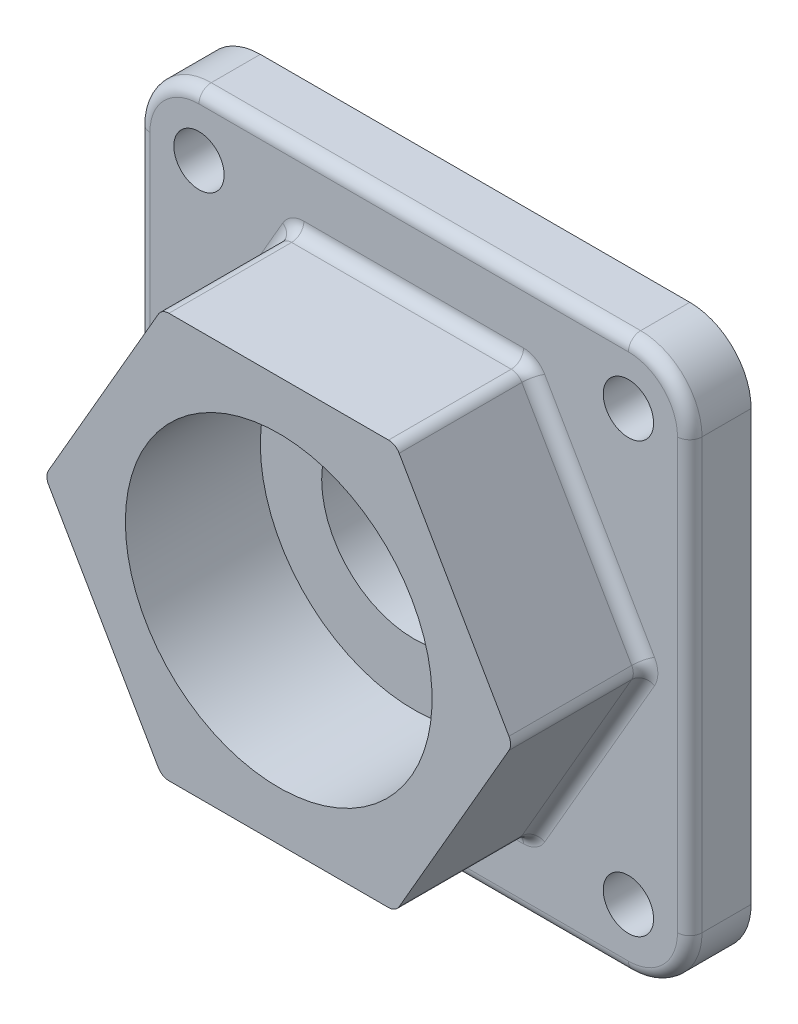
ISO-10303-21;
HEADER;
FILE_DESCRIPTION(('STEP AP214'),'2;1');
FILE_NAME('part.step','',(''),(''),'','','');
FILE_SCHEMA(('AUTOMOTIVE_DESIGN { 1 0 10303 214 1 1 1 1 }'));
ENDSEC;
DATA;
#1=APPLICATION_CONTEXT('core data for automotive mechanical design processes');
#2=APPLICATION_PROTOCOL_DEFINITION('international standard','automotive_design',2000,#1);
#3=PRODUCT_CONTEXT('',#1,'mechanical');
#4=PRODUCT('Part','Part','',(#3));
#5=PRODUCT_RELATED_PRODUCT_CATEGORY('part','',(#4));
#6=PRODUCT_DEFINITION_FORMATION('','',#4);
#7=PRODUCT_DEFINITION_CONTEXT('part definition',#1,'design');
#8=PRODUCT_DEFINITION('design','',#6,#7);
#9=PRODUCT_DEFINITION_SHAPE('','',#8);
#10=(LENGTH_UNIT() NAMED_UNIT(*) SI_UNIT(.MILLI.,.METRE.));
#11=(NAMED_UNIT(*) PLANE_ANGLE_UNIT() SI_UNIT($,.RADIAN.));
#12=(NAMED_UNIT(*) SI_UNIT($,.STERADIAN.) SOLID_ANGLE_UNIT());
#13=UNCERTAINTY_MEASURE_WITH_UNIT(LENGTH_MEASURE(1.E-05),#10,'distance_accuracy_value','');
#14=(GEOMETRIC_REPRESENTATION_CONTEXT(3) GLOBAL_UNCERTAINTY_ASSIGNED_CONTEXT((#13)) GLOBAL_UNIT_ASSIGNED_CONTEXT((#10,
#11,#12)) REPRESENTATION_CONTEXT('',''));
#15=CARTESIAN_POINT('',(0.,0.,0.));
#16=DIRECTION('',(0.,0.,1.));
#17=DIRECTION('',(1.,0.,0.));
#18=AXIS2_PLACEMENT_3D('',#15,#16,#17);
#19=CARTESIAN_POINT('',(35.,-35.,5.));
#20=DIRECTION('',(0.,0.,1.));
#21=DIRECTION('',(1.,0.,0.));
#22=AXIS2_PLACEMENT_3D('',#19,#20,#21);
#23=PLANE('',#22);
#24=CARTESIAN_POINT('',(-35.,35.,5.));
#25=DIRECTION('',(0.,0.,1.));
#26=DIRECTION('',(1.,0.,0.));
#27=AXIS2_PLACEMENT_3D('',#24,#25,#26);
#28=CIRCLE('',#27,4.1);
#29=CARTESIAN_POINT('',(-30.9,35.,5.));
#30=VERTEX_POINT('',#29);
#31=EDGE_CURVE('E506',#30,#30,#28,.T.);
#32=ORIENTED_EDGE('',*,*,#31,.F.);
#33=EDGE_LOOP('',(#32));
#34=FACE_BOUND('',#33,.T.);
#35=CARTESIAN_POINT('',(35.,35.,5.));
#36=DIRECTION('',(0.,0.,1.));
#37=DIRECTION('',(1.,0.,0.));
#38=AXIS2_PLACEMENT_3D('',#35,#36,#37);
#39=CIRCLE('',#38,4.09999999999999);
#40=CARTESIAN_POINT('',(39.1,35.,5.));
#41=VERTEX_POINT('',#40);
#42=EDGE_CURVE('E496',#41,#41,#39,.T.);
#43=ORIENTED_EDGE('',*,*,#42,.F.);
#44=EDGE_LOOP('',(#43));
#45=FACE_BOUND('',#44,.T.);
#46=CARTESIAN_POINT('',(35.,-35.,5.));
#47=DIRECTION('',(0.,0.,1.));
#48=DIRECTION('',(1.,0.,0.));
#49=AXIS2_PLACEMENT_3D('',#46,#47,#48);
#50=CIRCLE('',#49,4.1);
#51=CARTESIAN_POINT('',(39.1,-35.,5.));
#52=VERTEX_POINT('',#51);
#53=EDGE_CURVE('E493',#52,#52,#50,.T.);
#54=ORIENTED_EDGE('',*,*,#53,.F.);
#55=EDGE_LOOP('',(#54));
#56=FACE_BOUND('',#55,.T.);
#57=CARTESIAN_POINT('',(-35.,-35.,5.));
#58=DIRECTION('',(0.,0.,1.));
#59=DIRECTION('',(1.,0.,0.));
#60=AXIS2_PLACEMENT_3D('',#57,#58,#59);
#61=CIRCLE('',#60,4.1);
#62=CARTESIAN_POINT('',(-30.9,-35.,5.));
#63=VERTEX_POINT('',#62);
#64=EDGE_CURVE('E492',#63,#63,#61,.T.);
#65=ORIENTED_EDGE('',*,*,#64,.F.);
#66=EDGE_LOOP('',(#65));
#67=FACE_BOUND('',#66,.T.);
#68=CARTESIAN_POINT('',(17.8978583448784,31.,5.));
#69=DIRECTION('',(0.,0.,1.));
#70=DIRECTION('',(1.,0.,0.));
#71=AXIS2_PLACEMENT_3D('',#68,#69,#70);
#72=CIRCLE('',#71,4.);
#73=CARTESIAN_POINT('',(21.3619599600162,33.,5.));
#74=VERTEX_POINT('',#73);
#75=CARTESIAN_POINT('',(17.8978583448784,35.,5.));
#76=VERTEX_POINT('',#75);
#77=EDGE_CURVE('E353',#74,#76,#72,.T.);
#78=ORIENTED_EDGE('',*,*,#77,.F.);
#79=DIRECTION('',(-0.5,0.866025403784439,0.));
#80=VECTOR('',#79,1.);
#81=CARTESIAN_POINT('',(54.216333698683,-23.9054445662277,5.));
#82=LINE('',#81,#80);
#83=CARTESIAN_POINT('',(39.2598183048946,2.,5.));
#84=VERTEX_POINT('',#83);
#85=EDGE_CURVE('E359',#74,#84,#82,.F.);
#86=ORIENTED_EDGE('',*,*,#85,.T.);
#87=CARTESIAN_POINT('',(35.7957166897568,0.,5.));
#88=DIRECTION('',(0.,0.,1.));
#89=DIRECTION('',(1.,0.,0.));
#90=AXIS2_PLACEMENT_3D('',#87,#88,#89);
#91=CIRCLE('',#90,4.);
#92=CARTESIAN_POINT('',(39.2598183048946,-2.,5.));
#93=VERTEX_POINT('',#92);
#94=EDGE_CURVE('E356',#93,#84,#91,.T.);
#95=ORIENTED_EDGE('',*,*,#94,.F.);
#96=DIRECTION('',(0.5,0.866025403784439,0.));
#97=VECTOR('',#96,1.);
#98=CARTESIAN_POINT('',(23.9054445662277,-28.5945554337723,5.));
#99=LINE('',#98,#97);
#100=CARTESIAN_POINT('',(21.3619599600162,-33.,5.));
#101=VERTEX_POINT('',#100);
#102=EDGE_CURVE('E350',#93,#101,#99,.F.);
#103=ORIENTED_EDGE('',*,*,#102,.T.);
#104=CARTESIAN_POINT('',(17.8978583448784,-31.,5.));
#105=DIRECTION('',(0.,0.,1.));
#106=DIRECTION('',(1.,0.,0.));
#107=AXIS2_PLACEMENT_3D('',#104,#105,#106);
#108=CIRCLE('',#107,4.);
#109=CARTESIAN_POINT('',(17.8978583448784,-35.,5.));
#110=VERTEX_POINT('',#109);
#111=EDGE_CURVE('E347',#110,#101,#108,.T.);
#112=ORIENTED_EDGE('',*,*,#111,.F.);
#113=DIRECTION('',(1.,0.,0.));
#114=VECTOR('',#113,1.);
#115=CARTESIAN_POINT('',(35.,-35.,5.));
#116=LINE('',#115,#114);
#117=CARTESIAN_POINT('',(-17.8978583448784,-35.,5.));
#118=VERTEX_POINT('',#117);
#119=EDGE_CURVE('E345',#110,#118,#116,.F.);
#120=ORIENTED_EDGE('',*,*,#119,.T.);
#121=CARTESIAN_POINT('',(-17.8978583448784,-31.,5.));
#122=DIRECTION('',(0.,0.,1.));
#123=DIRECTION('',(1.,0.,0.));
#124=AXIS2_PLACEMENT_3D('',#121,#122,#123);
#125=CIRCLE('',#124,4.);
#126=CARTESIAN_POINT('',(-21.3619599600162,-33.,5.));
#127=VERTEX_POINT('',#126);
#128=EDGE_CURVE('E342',#127,#118,#125,.T.);
#129=ORIENTED_EDGE('',*,*,#128,.F.);
#130=DIRECTION('',(0.5,-0.866025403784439,0.));
#131=VECTOR('',#130,1.);
#132=CARTESIAN_POINT('',(-6.40544456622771,-58.9054445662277,5.));
#133=LINE('',#132,#131);
#134=CARTESIAN_POINT('',(-39.2598183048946,-1.99999999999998,5.));
#135=VERTEX_POINT('',#134);
#136=EDGE_CURVE('E338',#127,#135,#133,.F.);
#137=ORIENTED_EDGE('',*,*,#136,.T.);
#138=CARTESIAN_POINT('',(-35.7957166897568,0.,5.));
#139=DIRECTION('',(0.,0.,1.));
#140=DIRECTION('',(1.,0.,0.));
#141=AXIS2_PLACEMENT_3D('',#138,#139,#140);
#142=CIRCLE('',#141,4.);
#143=CARTESIAN_POINT('',(-39.2598183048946,2.00000000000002,5.));
#144=VERTEX_POINT('',#143);
#145=EDGE_CURVE('E335',#144,#135,#142,.T.);
#146=ORIENTED_EDGE('',*,*,#145,.F.);
#147=DIRECTION('',(-0.5,-0.866025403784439,0.));
#148=VECTOR('',#147,1.);
#149=CARTESIAN_POINT('',(-36.716333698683,6.4054445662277,5.));
#150=LINE('',#149,#148);
#151=CARTESIAN_POINT('',(-21.3619599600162,33.,5.));
#152=VERTEX_POINT('',#151);
#153=EDGE_CURVE('E333',#144,#152,#150,.F.);
#154=ORIENTED_EDGE('',*,*,#153,.T.);
#155=CARTESIAN_POINT('',(-17.8978583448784,31.,5.));
#156=DIRECTION('',(0.,0.,1.));
#157=DIRECTION('',(1.,0.,0.));
#158=AXIS2_PLACEMENT_3D('',#155,#156,#157);
#159=CIRCLE('',#158,4.);
#160=CARTESIAN_POINT('',(-17.8978583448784,35.,5.));
#161=VERTEX_POINT('',#160);
#162=EDGE_CURVE('E330',#161,#152,#159,.T.);
#163=ORIENTED_EDGE('',*,*,#162,.F.);
#164=DIRECTION('',(-1.,0.,0.));
#165=VECTOR('',#164,1.);
#166=CARTESIAN_POINT('',(35.,35.,5.));
#167=LINE('',#166,#165);
#168=EDGE_CURVE('E340',#161,#76,#167,.F.);
#169=ORIENTED_EDGE('',*,*,#168,.T.);
#170=EDGE_LOOP('',(#78,#86,#95,#103,#112,#120,#129,#137,#146,#154,#163,#169));
#171=FACE_BOUND('',#170,.T.);
#172=DIRECTION('',(-1.,0.,0.));
#173=VECTOR('',#172,1.);
#174=CARTESIAN_POINT('',(-34.9999999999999,43.,5.));
#175=LINE('',#174,#173);
#176=CARTESIAN_POINT('',(34.9999999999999,43.,5.));
#177=VERTEX_POINT('',#176);
#178=CARTESIAN_POINT('',(-35.,43.,5.));
#179=VERTEX_POINT('',#178);
#180=EDGE_CURVE('E325',#177,#179,#175,.T.);
#181=ORIENTED_EDGE('',*,*,#180,.T.);
#182=CARTESIAN_POINT('',(-35.,35.,5.));
#183=DIRECTION('',(0.,0.,1.));
#184=DIRECTION('',(1.,0.,0.));
#185=AXIS2_PLACEMENT_3D('',#182,#183,#184);
#186=CIRCLE('',#185,8.);
#187=CARTESIAN_POINT('',(-43.,34.9999999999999,5.));
#188=VERTEX_POINT('',#187);
#189=EDGE_CURVE('E327',#179,#188,#186,.T.);
#190=ORIENTED_EDGE('',*,*,#189,.T.);
#191=DIRECTION('',(0.,-1.,0.));
#192=VECTOR('',#191,1.);
#193=CARTESIAN_POINT('',(-43.,-34.9999999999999,5.));
#194=LINE('',#193,#192);
#195=CARTESIAN_POINT('',(-43.,-34.9999999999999,5.));
#196=VERTEX_POINT('',#195);
#197=EDGE_CURVE('E313',#188,#196,#194,.T.);
#198=ORIENTED_EDGE('',*,*,#197,.T.);
#199=CARTESIAN_POINT('',(-35.,-35.,5.));
#200=DIRECTION('',(0.,0.,1.));
#201=DIRECTION('',(1.,0.,0.));
#202=AXIS2_PLACEMENT_3D('',#199,#200,#201);
#203=CIRCLE('',#202,8.);
#204=CARTESIAN_POINT('',(-34.9999999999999,-43.,5.));
#205=VERTEX_POINT('',#204);
#206=EDGE_CURVE('E315',#196,#205,#203,.T.);
#207=ORIENTED_EDGE('',*,*,#206,.T.);
#208=DIRECTION('',(1.,0.,0.));
#209=VECTOR('',#208,1.);
#210=CARTESIAN_POINT('',(34.9999999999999,-43.,5.));
#211=LINE('',#210,#209);
#212=CARTESIAN_POINT('',(34.9999999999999,-43.,5.));
#213=VERTEX_POINT('',#212);
#214=EDGE_CURVE('E317',#205,#213,#211,.T.);
#215=ORIENTED_EDGE('',*,*,#214,.T.);
#216=CARTESIAN_POINT('',(35.,-35.,5.));
#217=DIRECTION('',(0.,0.,1.));
#218=DIRECTION('',(1.,0.,0.));
#219=AXIS2_PLACEMENT_3D('',#216,#217,#218);
#220=CIRCLE('',#219,8.);
#221=CARTESIAN_POINT('',(43.,-34.9999999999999,5.));
#222=VERTEX_POINT('',#221);
#223=EDGE_CURVE('E319',#213,#222,#220,.T.);
#224=ORIENTED_EDGE('',*,*,#223,.T.);
#225=DIRECTION('',(0.,1.,0.));
#226=VECTOR('',#225,1.);
#227=CARTESIAN_POINT('',(43.,34.9999999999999,5.));
#228=LINE('',#227,#226);
#229=CARTESIAN_POINT('',(43.,35.,5.));
#230=VERTEX_POINT('',#229);
#231=EDGE_CURVE('E321',#222,#230,#228,.T.);
#232=ORIENTED_EDGE('',*,*,#231,.T.);
#233=CARTESIAN_POINT('',(35.,35.,5.));
#234=DIRECTION('',(0.,0.,1.));
#235=DIRECTION('',(1.,0.,0.));
#236=AXIS2_PLACEMENT_3D('',#233,#234,#235);
#237=CIRCLE('',#236,8.);
#238=EDGE_CURVE('E323',#230,#177,#237,.T.);
#239=ORIENTED_EDGE('',*,*,#238,.T.);
#240=EDGE_LOOP('',(#181,#190,#198,#207,#215,#224,#232,#239));
#241=FACE_BOUND('',#240,.T.);
#242=ADVANCED_FACE('F46',(#34,#45,#56,#67,#171,#241),#23,.T.);
#243=CARTESIAN_POINT('',(35.,-35.,5.));
#244=DIRECTION('',(0.,0.,-1.));
#245=DIRECTION('',(-1.,0.,0.));
#246=AXIS2_PLACEMENT_3D('',#243,#244,#245);
#247=CYLINDRICAL_SURFACE('',#246,10.);
#248=DIRECTION('',(0.,0.,-1.));
#249=VECTOR('',#248,1.);
#250=CARTESIAN_POINT('',(45.,-34.9999999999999,5.));
#251=LINE('',#250,#249);
#252=CARTESIAN_POINT('',(45.,-34.9999999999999,3.));
#253=VERTEX_POINT('',#252);
#254=CARTESIAN_POINT('',(45.,-34.9999999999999,-5.));
#255=VERTEX_POINT('',#254);
#256=EDGE_CURVE('E243',#253,#255,#251,.T.);
#257=ORIENTED_EDGE('',*,*,#256,.F.);
#258=CARTESIAN_POINT('',(35.,-35.,3.));
#259=DIRECTION('',(0.,0.,1.));
#260=DIRECTION('',(1.,0.,0.));
#261=AXIS2_PLACEMENT_3D('',#258,#259,#260);
#262=CIRCLE('',#261,10.);
#263=CARTESIAN_POINT('',(34.9999999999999,-45.,3.));
#264=VERTEX_POINT('',#263);
#265=EDGE_CURVE('E393',#253,#264,#262,.F.);
#266=ORIENTED_EDGE('',*,*,#265,.T.);
#267=DIRECTION('',(0.,0.,-1.));
#268=VECTOR('',#267,1.);
#269=CARTESIAN_POINT('',(34.9999999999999,-45.,5.));
#270=LINE('',#269,#268);
#271=CARTESIAN_POINT('',(34.9999999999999,-45.,-5.));
#272=VERTEX_POINT('',#271);
#273=EDGE_CURVE('E268',#264,#272,#270,.T.);
#274=ORIENTED_EDGE('',*,*,#273,.T.);
#275=CARTESIAN_POINT('',(35.,-35.,-5.));
#276=DIRECTION('',(0.,0.,1.));
#277=DIRECTION('',(1.,0.,0.));
#278=AXIS2_PLACEMENT_3D('',#275,#276,#277);
#279=CIRCLE('',#278,10.);
#280=EDGE_CURVE('E261',#272,#255,#279,.T.);
#281=ORIENTED_EDGE('',*,*,#280,.T.);
#282=EDGE_LOOP('',(#257,#266,#274,#281));
#283=FACE_BOUND('',#282,.T.);
#284=ADVANCED_FACE('F266',(#283),#247,.T.);
#285=CARTESIAN_POINT('',(45.,34.9999999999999,5.));
#286=DIRECTION('',(-1.,0.,0.));
#287=DIRECTION('',(0.,-1.,0.));
#288=AXIS2_PLACEMENT_3D('',#285,#286,#287);
#289=PLANE('',#288);
#290=DIRECTION('',(0.,0.,-1.));
#291=VECTOR('',#290,1.);
#292=CARTESIAN_POINT('',(45.,34.9999999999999,5.));
#293=LINE('',#292,#291);
#294=CARTESIAN_POINT('',(45.,34.9999999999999,3.));
#295=VERTEX_POINT('',#294);
#296=CARTESIAN_POINT('',(45.,34.9999999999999,-5.));
#297=VERTEX_POINT('',#296);
#298=EDGE_CURVE('E255',#295,#297,#293,.T.);
#299=ORIENTED_EDGE('',*,*,#298,.F.);
#300=DIRECTION('',(0.,1.,0.));
#301=VECTOR('',#300,1.);
#302=CARTESIAN_POINT('',(45.,-34.9999999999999,3.));
#303=LINE('',#302,#301);
#304=EDGE_CURVE('E250',#295,#253,#303,.F.);
#305=ORIENTED_EDGE('',*,*,#304,.T.);
#306=ORIENTED_EDGE('',*,*,#256,.T.);
#307=DIRECTION('',(0.,1.,0.));
#308=VECTOR('',#307,1.);
#309=CARTESIAN_POINT('',(45.,34.9999999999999,-5.));
#310=LINE('',#309,#308);
#311=EDGE_CURVE('E247',#255,#297,#310,.T.);
#312=ORIENTED_EDGE('',*,*,#311,.T.);
#313=EDGE_LOOP('',(#299,#305,#306,#312));
#314=FACE_BOUND('',#313,.T.);
#315=ADVANCED_FACE('F246',(#314),#289,.F.);
#316=CARTESIAN_POINT('',(35.,35.,5.));
#317=DIRECTION('',(0.,0.,-1.));
#318=DIRECTION('',(-1.,0.,0.));
#319=AXIS2_PLACEMENT_3D('',#316,#317,#318);
#320=CYLINDRICAL_SURFACE('',#319,10.);
#321=DIRECTION('',(0.,0.,-1.));
#322=VECTOR('',#321,1.);
#323=CARTESIAN_POINT('',(34.9999999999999,45.,5.));
#324=LINE('',#323,#322);
#325=CARTESIAN_POINT('',(34.9999999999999,45.,3.));
#326=VERTEX_POINT('',#325);
#327=CARTESIAN_POINT('',(34.9999999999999,45.,-5.));
#328=VERTEX_POINT('',#327);
#329=EDGE_CURVE('E301',#326,#328,#324,.T.);
#330=ORIENTED_EDGE('',*,*,#329,.F.);
#331=CARTESIAN_POINT('',(35.,35.,3.));
#332=DIRECTION('',(0.,0.,1.));
#333=DIRECTION('',(1.,0.,0.));
#334=AXIS2_PLACEMENT_3D('',#331,#332,#333);
#335=CIRCLE('',#334,10.);
#336=EDGE_CURVE('E390',#326,#295,#335,.F.);
#337=ORIENTED_EDGE('',*,*,#336,.T.);
#338=ORIENTED_EDGE('',*,*,#298,.T.);
#339=CARTESIAN_POINT('',(35.,35.,-5.));
#340=DIRECTION('',(0.,0.,1.));
#341=DIRECTION('',(-1.,0.,0.));
#342=AXIS2_PLACEMENT_3D('',#339,#340,#341);
#343=CIRCLE('',#342,10.);
#344=EDGE_CURVE('E264',#297,#328,#343,.T.);
#345=ORIENTED_EDGE('',*,*,#344,.T.);
#346=EDGE_LOOP('',(#330,#337,#338,#345));
#347=FACE_BOUND('',#346,.T.);
#348=ADVANCED_FACE('F690',(#347),#320,.T.);
#349=CARTESIAN_POINT('',(-34.9999999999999,45.,5.));
#350=DIRECTION('',(0.,-1.,0.));
#351=DIRECTION('',(0.,0.,-1.));
#352=AXIS2_PLACEMENT_3D('',#349,#350,#351);
#353=PLANE('',#352);
#354=DIRECTION('',(0.,0.,-1.));
#355=VECTOR('',#354,1.);
#356=CARTESIAN_POINT('',(-34.9999999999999,45.,5.));
#357=LINE('',#356,#355);
#358=CARTESIAN_POINT('',(-34.9999999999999,45.,3.));
#359=VERTEX_POINT('',#358);
#360=CARTESIAN_POINT('',(-34.9999999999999,45.,-5.));
#361=VERTEX_POINT('',#360);
#362=EDGE_CURVE('E299',#359,#361,#357,.T.);
#363=ORIENTED_EDGE('',*,*,#362,.F.);
#364=DIRECTION('',(-1.,0.,0.));
#365=VECTOR('',#364,1.);
#366=CARTESIAN_POINT('',(34.9999999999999,45.,3.));
#367=LINE('',#366,#365);
#368=EDGE_CURVE('E388',#359,#326,#367,.F.);
#369=ORIENTED_EDGE('',*,*,#368,.T.);
#370=ORIENTED_EDGE('',*,*,#329,.T.);
#371=DIRECTION('',(-1.,0.,0.));
#372=VECTOR('',#371,1.);
#373=CARTESIAN_POINT('',(-34.9999999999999,45.,-5.));
#374=LINE('',#373,#372);
#375=EDGE_CURVE('E278',#328,#361,#374,.T.);
#376=ORIENTED_EDGE('',*,*,#375,.T.);
#377=EDGE_LOOP('',(#363,#369,#370,#376));
#378=FACE_BOUND('',#377,.T.);
#379=ADVANCED_FACE('F686',(#378),#353,.F.);
#380=CARTESIAN_POINT('',(-35.,35.,5.));
#381=DIRECTION('',(0.,0.,-1.));
#382=DIRECTION('',(-1.,0.,0.));
#383=AXIS2_PLACEMENT_3D('',#380,#381,#382);
#384=CYLINDRICAL_SURFACE('',#383,10.);
#385=DIRECTION('',(0.,0.,-1.));
#386=VECTOR('',#385,1.);
#387=CARTESIAN_POINT('',(-45.,34.9999999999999,5.));
#388=LINE('',#387,#386);
#389=CARTESIAN_POINT('',(-45.,34.9999999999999,3.));
#390=VERTEX_POINT('',#389);
#391=CARTESIAN_POINT('',(-45.,34.9999999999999,-5.));
#392=VERTEX_POINT('',#391);
#393=EDGE_CURVE('E297',#390,#392,#388,.T.);
#394=ORIENTED_EDGE('',*,*,#393,.F.);
#395=CARTESIAN_POINT('',(-35.,35.,3.));
#396=DIRECTION('',(0.,0.,1.));
#397=DIRECTION('',(1.,0.,0.));
#398=AXIS2_PLACEMENT_3D('',#395,#396,#397);
#399=CIRCLE('',#398,10.);
#400=EDGE_CURVE('E385',#390,#359,#399,.F.);
#401=ORIENTED_EDGE('',*,*,#400,.T.);
#402=ORIENTED_EDGE('',*,*,#362,.T.);
#403=CARTESIAN_POINT('',(-35.,35.,-5.));
#404=DIRECTION('',(0.,0.,1.));
#405=DIRECTION('',(1.,0.,0.));
#406=AXIS2_PLACEMENT_3D('',#403,#404,#405);
#407=CIRCLE('',#406,10.);
#408=EDGE_CURVE('E281',#361,#392,#407,.T.);
#409=ORIENTED_EDGE('',*,*,#408,.T.);
#410=EDGE_LOOP('',(#394,#401,#402,#409));
#411=FACE_BOUND('',#410,.T.);
#412=ADVANCED_FACE('F682',(#411),#384,.T.);
#413=CARTESIAN_POINT('',(-45.,34.9999999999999,5.));
#414=DIRECTION('',(1.,0.,0.));
#415=DIRECTION('',(0.,1.,0.));
#416=AXIS2_PLACEMENT_3D('',#413,#414,#415);
#417=PLANE('',#416);
#418=DIRECTION('',(0.,0.,-1.));
#419=VECTOR('',#418,1.);
#420=CARTESIAN_POINT('',(-45.,-34.9999999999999,5.));
#421=LINE('',#420,#419);
#422=CARTESIAN_POINT('',(-45.,-34.9999999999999,3.));
#423=VERTEX_POINT('',#422);
#424=CARTESIAN_POINT('',(-45.,-34.9999999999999,-5.));
#425=VERTEX_POINT('',#424);
#426=EDGE_CURVE('E295',#423,#425,#421,.T.);
#427=ORIENTED_EDGE('',*,*,#426,.F.);
#428=DIRECTION('',(0.,-1.,0.));
#429=VECTOR('',#428,1.);
#430=CARTESIAN_POINT('',(-45.,34.9999999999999,3.));
#431=LINE('',#430,#429);
#432=EDGE_CURVE('E13',#423,#390,#431,.F.);
#433=ORIENTED_EDGE('',*,*,#432,.T.);
#434=ORIENTED_EDGE('',*,*,#393,.T.);
#435=DIRECTION('',(0.,-1.,0.));
#436=VECTOR('',#435,1.);
#437=CARTESIAN_POINT('',(-45.,34.9999999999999,-5.));
#438=LINE('',#437,#436);
#439=EDGE_CURVE('E284',#392,#425,#438,.T.);
#440=ORIENTED_EDGE('',*,*,#439,.T.);
#441=EDGE_LOOP('',(#427,#433,#434,#440));
#442=FACE_BOUND('',#441,.T.);
#443=ADVANCED_FACE('F678',(#442),#417,.F.);
#444=CARTESIAN_POINT('',(-35.,-35.,5.));
#445=DIRECTION('',(0.,0.,-1.));
#446=DIRECTION('',(-1.,0.,0.));
#447=AXIS2_PLACEMENT_3D('',#444,#445,#446);
#448=CYLINDRICAL_SURFACE('',#447,10.);
#449=DIRECTION('',(0.,0.,-1.));
#450=VECTOR('',#449,1.);
#451=CARTESIAN_POINT('',(-34.9999999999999,-45.,5.));
#452=LINE('',#451,#450);
#453=CARTESIAN_POINT('',(-34.9999999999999,-45.,3.));
#454=VERTEX_POINT('',#453);
#455=CARTESIAN_POINT('',(-34.9999999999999,-45.,-5.));
#456=VERTEX_POINT('',#455);
#457=EDGE_CURVE('E293',#454,#456,#452,.T.);
#458=ORIENTED_EDGE('',*,*,#457,.F.);
#459=CARTESIAN_POINT('',(-35.,-35.,3.));
#460=DIRECTION('',(0.,0.,1.));
#461=DIRECTION('',(1.,0.,0.));
#462=AXIS2_PLACEMENT_3D('',#459,#460,#461);
#463=CIRCLE('',#462,10.);
#464=EDGE_CURVE('E397',#454,#423,#463,.F.);
#465=ORIENTED_EDGE('',*,*,#464,.T.);
#466=ORIENTED_EDGE('',*,*,#426,.T.);
#467=CARTESIAN_POINT('',(-35.,-35.,-5.));
#468=DIRECTION('',(0.,0.,1.));
#469=DIRECTION('',(1.,0.,0.));
#470=AXIS2_PLACEMENT_3D('',#467,#468,#469);
#471=CIRCLE('',#470,10.);
#472=EDGE_CURVE('E287',#425,#456,#471,.T.);
#473=ORIENTED_EDGE('',*,*,#472,.T.);
#474=EDGE_LOOP('',(#458,#465,#466,#473));
#475=FACE_BOUND('',#474,.T.);
#476=ADVANCED_FACE('F674',(#475),#448,.T.);
#477=CARTESIAN_POINT('',(-34.9999999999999,-45.,5.));
#478=DIRECTION('',(0.,1.,0.));
#479=DIRECTION('',(0.,0.,1.));
#480=AXIS2_PLACEMENT_3D('',#477,#478,#479);
#481=PLANE('',#480);
#482=ORIENTED_EDGE('',*,*,#273,.F.);
#483=DIRECTION('',(1.,0.,0.));
#484=VECTOR('',#483,1.);
#485=CARTESIAN_POINT('',(-34.9999999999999,-45.,3.));
#486=LINE('',#485,#484);
#487=EDGE_CURVE('E395',#264,#454,#486,.F.);
#488=ORIENTED_EDGE('',*,*,#487,.T.);
#489=ORIENTED_EDGE('',*,*,#457,.T.);
#490=DIRECTION('',(1.,0.,0.));
#491=VECTOR('',#490,1.);
#492=CARTESIAN_POINT('',(-34.9999999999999,-45.,-5.));
#493=LINE('',#492,#491);
#494=EDGE_CURVE('E290',#456,#272,#493,.T.);
#495=ORIENTED_EDGE('',*,*,#494,.T.);
#496=EDGE_LOOP('',(#482,#488,#489,#495));
#497=FACE_BOUND('',#496,.T.);
#498=ADVANCED_FACE('F670',(#497),#481,.F.);
#499=CARTESIAN_POINT('',(35.,-35.,-5.));
#500=DIRECTION('',(0.,0.,1.));
#501=DIRECTION('',(1.,0.,0.));
#502=AXIS2_PLACEMENT_3D('',#499,#500,#501);
#503=PLANE('',#502);
#504=CARTESIAN_POINT('',(-35.,35.,-5.));
#505=DIRECTION('',(0.,0.,1.));
#506=DIRECTION('',(1.,0.,0.));
#507=AXIS2_PLACEMENT_3D('',#504,#505,#506);
#508=CIRCLE('',#507,4.09999999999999);
#509=CARTESIAN_POINT('',(-30.9,35.,-5.));
#510=VERTEX_POINT('',#509);
#511=EDGE_CURVE('E50',#510,#510,#508,.T.);
#512=ORIENTED_EDGE('',*,*,#511,.T.);
#513=EDGE_LOOP('',(#512));
#514=FACE_BOUND('',#513,.T.);
#515=CARTESIAN_POINT('',(35.,35.,-5.));
#516=DIRECTION('',(0.,0.,1.));
#517=DIRECTION('',(1.,0.,0.));
#518=AXIS2_PLACEMENT_3D('',#515,#516,#517);
#519=CIRCLE('',#518,4.09999999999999);
#520=CARTESIAN_POINT('',(39.1,35.,-5.));
#521=VERTEX_POINT('',#520);
#522=EDGE_CURVE('E494',#521,#521,#519,.T.);
#523=ORIENTED_EDGE('',*,*,#522,.T.);
#524=EDGE_LOOP('',(#523));
#525=FACE_BOUND('',#524,.T.);
#526=CARTESIAN_POINT('',(35.,-35.,-5.));
#527=DIRECTION('',(0.,0.,1.));
#528=DIRECTION('',(1.,0.,0.));
#529=AXIS2_PLACEMENT_3D('',#526,#527,#528);
#530=CIRCLE('',#529,4.1);
#531=CARTESIAN_POINT('',(39.1,-35.,-5.));
#532=VERTEX_POINT('',#531);
#533=EDGE_CURVE('E490',#532,#532,#530,.T.);
#534=ORIENTED_EDGE('',*,*,#533,.T.);
#535=EDGE_LOOP('',(#534));
#536=FACE_BOUND('',#535,.T.);
#537=CARTESIAN_POINT('',(-35.,-35.,-5.));
#538=DIRECTION('',(0.,0.,1.));
#539=DIRECTION('',(1.,0.,0.));
#540=AXIS2_PLACEMENT_3D('',#537,#538,#539);
#541=CIRCLE('',#540,4.09999999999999);
#542=CARTESIAN_POINT('',(-30.9,-35.,-5.));
#543=VERTEX_POINT('',#542);
#544=EDGE_CURVE('E471',#543,#543,#541,.T.);
#545=ORIENTED_EDGE('',*,*,#544,.T.);
#546=EDGE_LOOP('',(#545));
#547=FACE_BOUND('',#546,.T.);
#548=CARTESIAN_POINT('',(0.,0.,-5.));
#549=DIRECTION('',(0.,0.,1.));
#550=DIRECTION('',(1.,0.,0.));
#551=AXIS2_PLACEMENT_3D('',#548,#549,#550);
#552=CIRCLE('',#551,32.5);
#553=CARTESIAN_POINT('',(32.5,0.,-5.));
#554=VERTEX_POINT('',#553);
#555=EDGE_CURVE('E254',#554,#554,#552,.F.);
#556=ORIENTED_EDGE('',*,*,#555,.F.);
#557=EDGE_LOOP('',(#556));
#558=FACE_BOUND('',#557,.T.);
#559=ORIENTED_EDGE('',*,*,#280,.F.);
#560=ORIENTED_EDGE('',*,*,#494,.F.);
#561=ORIENTED_EDGE('',*,*,#472,.F.);
#562=ORIENTED_EDGE('',*,*,#439,.F.);
#563=ORIENTED_EDGE('',*,*,#408,.F.);
#564=ORIENTED_EDGE('',*,*,#375,.F.);
#565=ORIENTED_EDGE('',*,*,#344,.F.);
#566=ORIENTED_EDGE('',*,*,#311,.F.);
#567=EDGE_LOOP('',(#559,#560,#561,#562,#563,#564,#565,#566));
#568=FACE_BOUND('',#567,.T.);
#569=ADVANCED_FACE('F259',(#514,#525,#536,#547,#558,#568),#503,.F.);
#570=CARTESIAN_POINT('',(-19.0525588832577,-33.,27.));
#571=DIRECTION('',(0.,1.,0.));
#572=DIRECTION('',(0.,0.,1.));
#573=AXIS2_PLACEMENT_3D('',#570,#571,#572);
#574=PLANE('',#573);
#575=DIRECTION('',(1.,0.,0.));
#576=VECTOR('',#575,1.);
#577=CARTESIAN_POINT('',(-19.0525588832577,-33.,27.));
#578=LINE('',#577,#576);
#579=CARTESIAN_POINT('',(-17.8978583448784,-33.,27.));
#580=VERTEX_POINT('',#579);
#581=CARTESIAN_POINT('',(17.8978583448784,-33.,27.));
#582=VERTEX_POINT('',#581);
#583=EDGE_CURVE('E536',#580,#582,#578,.T.);
#584=ORIENTED_EDGE('',*,*,#583,.F.);
#585=DIRECTION('',(0.,0.,-1.));
#586=VECTOR('',#585,1.);
#587=CARTESIAN_POINT('',(-17.8978583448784,-33.,27.));
#588=LINE('',#587,#586);
#589=CARTESIAN_POINT('',(-17.8978583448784,-33.,7.));
#590=VERTEX_POINT('',#589);
#591=EDGE_CURVE('E371',#580,#590,#588,.T.);
#592=ORIENTED_EDGE('',*,*,#591,.T.);
#593=DIRECTION('',(1.,0.,0.));
#594=VECTOR('',#593,1.);
#595=CARTESIAN_POINT('',(-19.0525588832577,-33.,7.));
#596=LINE('',#595,#594);
#597=CARTESIAN_POINT('',(17.8978583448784,-33.,7.));
#598=VERTEX_POINT('',#597);
#599=EDGE_CURVE('E369',#590,#598,#596,.T.);
#600=ORIENTED_EDGE('',*,*,#599,.T.);
#601=DIRECTION('',(0.,0.,-1.));
#602=VECTOR('',#601,1.);
#603=CARTESIAN_POINT('',(17.8978583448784,-33.,27.));
#604=LINE('',#603,#602);
#605=EDGE_CURVE('E367',#598,#582,#604,.F.);
#606=ORIENTED_EDGE('',*,*,#605,.T.);
#607=EDGE_LOOP('',(#584,#592,#600,#606));
#608=FACE_BOUND('',#607,.T.);
#609=ADVANCED_FACE('F572',(#608),#574,.F.);
#610=CARTESIAN_POINT('',(19.0525588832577,-33.,27.));
#611=DIRECTION('',(-0.866025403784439,0.5,0.));
#612=DIRECTION('',(-0.5,-0.866025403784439,0.));
#613=AXIS2_PLACEMENT_3D('',#610,#611,#612);
#614=PLANE('',#613);
#615=DIRECTION('',(0.5,0.866025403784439,0.));
#616=VECTOR('',#615,1.);
#617=CARTESIAN_POINT('',(19.0525588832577,-33.,27.));
#618=LINE('',#617,#616);
#619=CARTESIAN_POINT('',(19.6299091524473,-32.,27.));
#620=VERTEX_POINT('',#619);
#621=CARTESIAN_POINT('',(37.5277674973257,-1.,27.));
#622=VERTEX_POINT('',#621);
#623=EDGE_CURVE('E539',#620,#622,#618,.T.);
#624=ORIENTED_EDGE('',*,*,#623,.F.);
#625=DIRECTION('',(0.,0.,-1.));
#626=VECTOR('',#625,1.);
#627=CARTESIAN_POINT('',(19.6299091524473,-32.,27.));
#628=LINE('',#627,#626);
#629=CARTESIAN_POINT('',(19.6299091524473,-32.,7.));
#630=VERTEX_POINT('',#629);
#631=EDGE_CURVE('E311',#620,#630,#628,.T.);
#632=ORIENTED_EDGE('',*,*,#631,.T.);
#633=DIRECTION('',(0.5,0.866025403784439,0.));
#634=VECTOR('',#633,1.);
#635=CARTESIAN_POINT('',(19.0525588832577,-33.,7.));
#636=LINE('',#635,#634);
#637=CARTESIAN_POINT('',(37.5277674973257,-0.999999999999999,7.));
#638=VERTEX_POINT('',#637);
#639=EDGE_CURVE('E308',#630,#638,#636,.T.);
#640=ORIENTED_EDGE('',*,*,#639,.T.);
#641=DIRECTION('',(0.,0.,-1.));
#642=VECTOR('',#641,1.);
#643=CARTESIAN_POINT('',(37.5277674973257,-0.999999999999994,27.));
#644=LINE('',#643,#642);
#645=EDGE_CURVE('E306',#638,#622,#644,.F.);
#646=ORIENTED_EDGE('',*,*,#645,.T.);
#647=EDGE_LOOP('',(#624,#632,#640,#646));
#648=FACE_BOUND('',#647,.T.);
#649=ADVANCED_FACE('F584',(#648),#614,.F.);
#650=CARTESIAN_POINT('',(38.1051177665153,0.,27.));
#651=DIRECTION('',(-0.866025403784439,-0.5,0.));
#652=DIRECTION('',(0.5,-0.866025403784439,0.));
#653=AXIS2_PLACEMENT_3D('',#650,#651,#652);
#654=PLANE('',#653);
#655=DIRECTION('',(-0.5,0.866025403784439,0.));
#656=VECTOR('',#655,1.);
#657=CARTESIAN_POINT('',(38.1051177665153,0.,27.));
#658=LINE('',#657,#656);
#659=CARTESIAN_POINT('',(37.5277674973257,1.,27.));
#660=VERTEX_POINT('',#659);
#661=CARTESIAN_POINT('',(19.6299091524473,32.,27.));
#662=VERTEX_POINT('',#661);
#663=EDGE_CURVE('E542',#660,#662,#658,.T.);
#664=ORIENTED_EDGE('',*,*,#663,.F.);
#665=DIRECTION('',(0.,0.,-1.));
#666=VECTOR('',#665,1.);
#667=CARTESIAN_POINT('',(37.5277674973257,1.,27.));
#668=LINE('',#667,#666);
#669=CARTESIAN_POINT('',(37.5277674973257,1.,7.));
#670=VERTEX_POINT('',#669);
#671=EDGE_CURVE('E365',#660,#670,#668,.T.);
#672=ORIENTED_EDGE('',*,*,#671,.T.);
#673=DIRECTION('',(-0.5,0.866025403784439,0.));
#674=VECTOR('',#673,1.);
#675=CARTESIAN_POINT('',(38.1051177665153,0.,7.));
#676=LINE('',#675,#674);
#677=CARTESIAN_POINT('',(19.6299091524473,32.,7.));
#678=VERTEX_POINT('',#677);
#679=EDGE_CURVE('E363',#670,#678,#676,.T.);
#680=ORIENTED_EDGE('',*,*,#679,.T.);
#681=DIRECTION('',(0.,0.,-1.));
#682=VECTOR('',#681,1.);
#683=CARTESIAN_POINT('',(19.6299091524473,32.,27.));
#684=LINE('',#683,#682);
#685=EDGE_CURVE('E361',#678,#662,#684,.F.);
#686=ORIENTED_EDGE('',*,*,#685,.T.);
#687=EDGE_LOOP('',(#664,#672,#680,#686));
#688=FACE_BOUND('',#687,.T.);
#689=ADVANCED_FACE('F595',(#688),#654,.F.);
#690=CARTESIAN_POINT('',(19.0525588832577,33.,27.));
#691=DIRECTION('',(0.,-1.,0.));
#692=DIRECTION('',(0.,0.,-1.));
#693=AXIS2_PLACEMENT_3D('',#690,#691,#692);
#694=PLANE('',#693);
#695=DIRECTION('',(-1.,0.,0.));
#696=VECTOR('',#695,1.);
#697=CARTESIAN_POINT('',(19.0525588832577,33.,27.));
#698=LINE('',#697,#696);
#699=CARTESIAN_POINT('',(17.8978583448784,33.,27.));
#700=VERTEX_POINT('',#699);
#701=CARTESIAN_POINT('',(-17.8978583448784,33.,27.));
#702=VERTEX_POINT('',#701);
#703=EDGE_CURVE('E545',#700,#702,#698,.T.);
#704=ORIENTED_EDGE('',*,*,#703,.F.);
#705=DIRECTION('',(0.,0.,-1.));
#706=VECTOR('',#705,1.);
#707=CARTESIAN_POINT('',(17.8978583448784,33.,27.));
#708=LINE('',#707,#706);
#709=CARTESIAN_POINT('',(17.8978583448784,33.,7.));
#710=VERTEX_POINT('',#709);
#711=EDGE_CURVE('E377',#700,#710,#708,.T.);
#712=ORIENTED_EDGE('',*,*,#711,.T.);
#713=DIRECTION('',(-1.,0.,0.));
#714=VECTOR('',#713,1.);
#715=CARTESIAN_POINT('',(19.0525588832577,33.,7.));
#716=LINE('',#715,#714);
#717=CARTESIAN_POINT('',(-17.8978583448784,33.,7.));
#718=VERTEX_POINT('',#717);
#719=EDGE_CURVE('E375',#710,#718,#716,.T.);
#720=ORIENTED_EDGE('',*,*,#719,.T.);
#721=DIRECTION('',(0.,0.,-1.));
#722=VECTOR('',#721,1.);
#723=CARTESIAN_POINT('',(-17.8978583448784,33.,27.));
#724=LINE('',#723,#722);
#725=EDGE_CURVE('E373',#718,#702,#724,.F.);
#726=ORIENTED_EDGE('',*,*,#725,.T.);
#727=EDGE_LOOP('',(#704,#712,#720,#726));
#728=FACE_BOUND('',#727,.T.);
#729=ADVANCED_FACE('F612',(#728),#694,.F.);
#730=CARTESIAN_POINT('',(-19.0525588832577,33.,27.));
#731=DIRECTION('',(0.866025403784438,-0.5,0.));
#732=DIRECTION('',(0.5,0.866025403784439,0.));
#733=AXIS2_PLACEMENT_3D('',#730,#731,#732);
#734=PLANE('',#733);
#735=DIRECTION('',(-0.5,-0.866025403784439,0.));
#736=VECTOR('',#735,1.);
#737=CARTESIAN_POINT('',(-19.0525588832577,33.,7.));
#738=LINE('',#737,#736);
#739=CARTESIAN_POINT('',(-19.6299091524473,32.,7.));
#740=VERTEX_POINT('',#739);
#741=CARTESIAN_POINT('',(-37.5277674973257,1.00000000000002,7.));
#742=VERTEX_POINT('',#741);
#743=EDGE_CURVE('E63',#740,#742,#738,.T.);
#744=ORIENTED_EDGE('',*,*,#743,.T.);
#745=DIRECTION('',(0.,0.,-1.));
#746=VECTOR('',#745,1.);
#747=CARTESIAN_POINT('',(-37.5277674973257,1.00000000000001,27.));
#748=LINE('',#747,#746);
#749=CARTESIAN_POINT('',(-37.5277674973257,1.00000000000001,27.));
#750=VERTEX_POINT('',#749);
#751=EDGE_CURVE('E401',#742,#750,#748,.F.);
#752=ORIENTED_EDGE('',*,*,#751,.T.);
#753=DIRECTION('',(-0.5,-0.866025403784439,0.));
#754=VECTOR('',#753,1.);
#755=CARTESIAN_POINT('',(-19.0525588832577,33.,27.));
#756=LINE('',#755,#754);
#757=CARTESIAN_POINT('',(-19.6299091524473,32.,27.));
#758=VERTEX_POINT('',#757);
#759=EDGE_CURVE('E273',#758,#750,#756,.T.);
#760=ORIENTED_EDGE('',*,*,#759,.F.);
#761=DIRECTION('',(0.,0.,-1.));
#762=VECTOR('',#761,1.);
#763=CARTESIAN_POINT('',(-19.6299091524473,32.,27.));
#764=LINE('',#763,#762);
#765=EDGE_CURVE('E68',#758,#740,#764,.T.);
#766=ORIENTED_EDGE('',*,*,#765,.T.);
#767=EDGE_LOOP('',(#744,#752,#760,#766));
#768=FACE_BOUND('',#767,.T.);
#769=ADVANCED_FACE('F751',(#768),#734,.F.);
#770=CARTESIAN_POINT('',(-38.1051177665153,0.,27.));
#771=DIRECTION('',(0.866025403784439,0.5,0.));
#772=DIRECTION('',(-0.5,0.866025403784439,0.));
#773=AXIS2_PLACEMENT_3D('',#770,#771,#772);
#774=PLANE('',#773);
#775=DIRECTION('',(0.5,-0.866025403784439,0.));
#776=VECTOR('',#775,1.);
#777=CARTESIAN_POINT('',(-38.1051177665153,0.,27.));
#778=LINE('',#777,#776);
#779=CARTESIAN_POINT('',(-37.5277674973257,-0.999999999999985,27.));
#780=VERTEX_POINT('',#779);
#781=CARTESIAN_POINT('',(-19.6299091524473,-32.,27.));
#782=VERTEX_POINT('',#781);
#783=EDGE_CURVE('E270',#780,#782,#778,.T.);
#784=ORIENTED_EDGE('',*,*,#783,.F.);
#785=DIRECTION('',(0.,0.,-1.));
#786=VECTOR('',#785,1.);
#787=CARTESIAN_POINT('',(-37.5277674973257,-0.999999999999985,27.));
#788=LINE('',#787,#786);
#789=CARTESIAN_POINT('',(-37.5277674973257,-0.999999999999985,7.));
#790=VERTEX_POINT('',#789);
#791=EDGE_CURVE('E383',#780,#790,#788,.T.);
#792=ORIENTED_EDGE('',*,*,#791,.T.);
#793=DIRECTION('',(0.5,-0.866025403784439,0.));
#794=VECTOR('',#793,1.);
#795=CARTESIAN_POINT('',(-38.1051177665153,0.,7.));
#796=LINE('',#795,#794);
#797=CARTESIAN_POINT('',(-19.6299091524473,-32.,7.));
#798=VERTEX_POINT('',#797);
#799=EDGE_CURVE('E381',#790,#798,#796,.T.);
#800=ORIENTED_EDGE('',*,*,#799,.T.);
#801=DIRECTION('',(0.,0.,-1.));
#802=VECTOR('',#801,1.);
#803=CARTESIAN_POINT('',(-19.6299091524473,-32.,27.));
#804=LINE('',#803,#802);
#805=EDGE_CURVE('E379',#798,#782,#804,.F.);
#806=ORIENTED_EDGE('',*,*,#805,.T.);
#807=EDGE_LOOP('',(#784,#792,#800,#806));
#808=FACE_BOUND('',#807,.T.);
#809=ADVANCED_FACE('F560',(#808),#774,.F.);
#810=CARTESIAN_POINT('',(0.,0.,27.));
#811=DIRECTION('',(0.,0.,1.));
#812=DIRECTION('',(1.,0.,0.));
#813=AXIS2_PLACEMENT_3D('',#810,#811,#812);
#814=PLANE('',#813);
#815=CARTESIAN_POINT('',(0.,0.,27.));
#816=DIRECTION('',(0.,0.,-1.));
#817=DIRECTION('',(-1.,0.,0.));
#818=AXIS2_PLACEMENT_3D('',#815,#816,#817);
#819=CIRCLE('',#818,25.);
#820=CARTESIAN_POINT('',(-25.,0.,27.));
#821=VERTEX_POINT('',#820);
#822=EDGE_CURVE('E467',#821,#821,#819,.T.);
#823=ORIENTED_EDGE('',*,*,#822,.T.);
#824=EDGE_LOOP('',(#823));
#825=FACE_BOUND('',#824,.T.);
#826=ORIENTED_EDGE('',*,*,#759,.T.);
#827=CARTESIAN_POINT('',(-35.7957166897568,0.,27.));
#828=DIRECTION('',(0.,0.,1.));
#829=DIRECTION('',(1.,0.,0.));
#830=AXIS2_PLACEMENT_3D('',#827,#828,#829);
#831=CIRCLE('',#830,2.);
#832=EDGE_CURVE('E55',#750,#780,#831,.T.);
#833=ORIENTED_EDGE('',*,*,#832,.T.);
#834=ORIENTED_EDGE('',*,*,#783,.T.);
#835=CARTESIAN_POINT('',(-17.8978583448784,-31.,27.));
#836=DIRECTION('',(0.,0.,1.));
#837=DIRECTION('',(1.,0.,0.));
#838=AXIS2_PLACEMENT_3D('',#835,#836,#837);
#839=CIRCLE('',#838,2.);
#840=EDGE_CURVE('E411',#782,#580,#839,.T.);
#841=ORIENTED_EDGE('',*,*,#840,.T.);
#842=ORIENTED_EDGE('',*,*,#583,.T.);
#843=CARTESIAN_POINT('',(17.8978583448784,-31.,27.));
#844=DIRECTION('',(0.,0.,1.));
#845=DIRECTION('',(1.,0.,0.));
#846=AXIS2_PLACEMENT_3D('',#843,#844,#845);
#847=CIRCLE('',#846,2.);
#848=EDGE_CURVE('E409',#582,#620,#847,.T.);
#849=ORIENTED_EDGE('',*,*,#848,.T.);
#850=ORIENTED_EDGE('',*,*,#623,.T.);
#851=CARTESIAN_POINT('',(35.7957166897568,0.,27.));
#852=DIRECTION('',(0.,0.,1.));
#853=DIRECTION('',(1.,0.,0.));
#854=AXIS2_PLACEMENT_3D('',#851,#852,#853);
#855=CIRCLE('',#854,2.);
#856=EDGE_CURVE('E407',#622,#660,#855,.T.);
#857=ORIENTED_EDGE('',*,*,#856,.T.);
#858=ORIENTED_EDGE('',*,*,#663,.T.);
#859=CARTESIAN_POINT('',(17.8978583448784,31.,27.));
#860=DIRECTION('',(0.,0.,1.));
#861=DIRECTION('',(1.,0.,0.));
#862=AXIS2_PLACEMENT_3D('',#859,#860,#861);
#863=CIRCLE('',#862,2.);
#864=EDGE_CURVE('E405',#662,#700,#863,.T.);
#865=ORIENTED_EDGE('',*,*,#864,.T.);
#866=ORIENTED_EDGE('',*,*,#703,.T.);
#867=CARTESIAN_POINT('',(-17.8978583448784,31.,27.));
#868=DIRECTION('',(0.,0.,1.));
#869=DIRECTION('',(1.,0.,0.));
#870=AXIS2_PLACEMENT_3D('',#867,#868,#869);
#871=CIRCLE('',#870,2.);
#872=EDGE_CURVE('E403',#702,#758,#871,.T.);
#873=ORIENTED_EDGE('',*,*,#872,.T.);
#874=EDGE_LOOP('',(#826,#833,#834,#841,#842,#849,#850,#857,#858,#865,#866,#873));
#875=FACE_BOUND('',#874,.T.);
#876=ADVANCED_FACE('F550',(#825,#875),#814,.T.);
#877=CARTESIAN_POINT('',(0.,0.,-7.5));
#878=DIRECTION('',(0.,0.,1.));
#879=DIRECTION('',(1.,0.,0.));
#880=AXIS2_PLACEMENT_3D('',#877,#878,#879);
#881=CYLINDRICAL_SURFACE('',#880,32.5);
#882=CARTESIAN_POINT('',(0.,0.,-7.5));
#883=DIRECTION('',(0.,0.,-1.));
#884=DIRECTION('',(-1.,0.,0.));
#885=AXIS2_PLACEMENT_3D('',#882,#883,#884);
#886=CIRCLE('',#885,32.5);
#887=CARTESIAN_POINT('',(-32.5,0.,-7.5));
#888=VERTEX_POINT('',#887);
#889=EDGE_CURVE('E531',#888,#888,#886,.T.);
#890=ORIENTED_EDGE('',*,*,#889,.F.);
#891=EDGE_LOOP('',(#890));
#892=FACE_BOUND('',#891,.T.);
#893=ORIENTED_EDGE('',*,*,#555,.T.);
#894=EDGE_LOOP('',(#893));
#895=FACE_BOUND('',#894,.T.);
#896=ADVANCED_FACE('F770',(#892,#895),#881,.T.);
#897=CARTESIAN_POINT('',(0.,0.,-7.5));
#898=DIRECTION('',(0.,0.,-1.));
#899=DIRECTION('',(-1.,0.,0.));
#900=AXIS2_PLACEMENT_3D('',#897,#898,#899);
#901=PLANE('',#900);
#902=CARTESIAN_POINT('',(0.,0.,-7.5));
#903=DIRECTION('',(0.,0.,-1.));
#904=DIRECTION('',(-1.,0.,0.));
#905=AXIS2_PLACEMENT_3D('',#902,#903,#904);
#906=CIRCLE('',#905,27.5);
#907=CARTESIAN_POINT('',(27.5,0.,-7.5));
#908=VERTEX_POINT('',#907);
#909=EDGE_CURVE('E527',#908,#908,#906,.T.);
#910=ORIENTED_EDGE('',*,*,#909,.F.);
#911=EDGE_LOOP('',(#910));
#912=FACE_BOUND('',#911,.T.);
#913=ORIENTED_EDGE('',*,*,#889,.T.);
#914=EDGE_LOOP('',(#913));
#915=FACE_BOUND('',#914,.T.);
#916=ADVANCED_FACE('F779',(#912,#915),#901,.T.);
#917=CARTESIAN_POINT('',(0.,0.,-20.5));
#918=DIRECTION('',(0.,0.,1.));
#919=DIRECTION('',(1.,0.,0.));
#920=AXIS2_PLACEMENT_3D('',#917,#918,#919);
#921=CYLINDRICAL_SURFACE('',#920,27.5);
#922=CARTESIAN_POINT('',(0.,0.,-20.5));
#923=DIRECTION('',(0.,0.,-1.));
#924=DIRECTION('',(-1.,0.,0.));
#925=AXIS2_PLACEMENT_3D('',#922,#923,#924);
#926=CIRCLE('',#925,27.5);
#927=CARTESIAN_POINT('',(27.5,0.,-20.5));
#928=VERTEX_POINT('',#927);
#929=EDGE_CURVE('E528',#928,#928,#926,.T.);
#930=CARTESIAN_POINT('',(27.5,0.,-20.5));
#931=CARTESIAN_POINT('',(27.5,0.,-20.3645833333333));
#932=CARTESIAN_POINT('',(27.5,0.,-20.2291666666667));
#933=CARTESIAN_POINT('',(27.5,0.,-19.9583333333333));
#934=CARTESIAN_POINT('',(27.5,0.,-19.8229166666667));
#935=CARTESIAN_POINT('',(27.5,0.,-19.5520833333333));
#936=CARTESIAN_POINT('',(27.5,0.,-19.4166666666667));
#937=CARTESIAN_POINT('',(27.5,0.,-19.1458333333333));
#938=CARTESIAN_POINT('',(27.5,0.,-19.0104166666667));
#939=CARTESIAN_POINT('',(27.5,0.,-18.7395833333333));
#940=CARTESIAN_POINT('',(27.5,0.,-18.6041666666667));
#941=CARTESIAN_POINT('',(27.5,0.,-18.3333333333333));
#942=CARTESIAN_POINT('',(27.5,0.,-18.1979166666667));
#943=CARTESIAN_POINT('',(27.5,0.,-17.9270833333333));
#944=CARTESIAN_POINT('',(27.5,0.,-17.7916666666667));
#945=CARTESIAN_POINT('',(27.5,0.,-17.5208333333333));
#946=CARTESIAN_POINT('',(27.5,0.,-17.3854166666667));
#947=CARTESIAN_POINT('',(27.5,0.,-17.1145833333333));
#948=CARTESIAN_POINT('',(27.5,0.,-16.9791666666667));
#949=CARTESIAN_POINT('',(27.5,0.,-16.7083333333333));
#950=CARTESIAN_POINT('',(27.5,0.,-16.5729166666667));
#951=CARTESIAN_POINT('',(27.5,0.,-16.3020833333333));
#952=CARTESIAN_POINT('',(27.5,0.,-16.1666666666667));
#953=CARTESIAN_POINT('',(27.5,0.,-15.8958333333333));
#954=CARTESIAN_POINT('',(27.5,0.,-15.7604166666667));
#955=CARTESIAN_POINT('',(27.5,0.,-15.4895833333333));
#956=CARTESIAN_POINT('',(27.5,0.,-15.3541666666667));
#957=CARTESIAN_POINT('',(27.5,0.,-15.0833333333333));
#958=CARTESIAN_POINT('',(27.5,0.,-14.9479166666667));
#959=CARTESIAN_POINT('',(27.5,0.,-14.6770833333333));
#960=CARTESIAN_POINT('',(27.5,0.,-14.5416666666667));
#961=CARTESIAN_POINT('',(27.5,0.,-14.2708333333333));
#962=CARTESIAN_POINT('',(27.5,0.,-14.1354166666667));
#963=CARTESIAN_POINT('',(27.5,0.,-13.8645833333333));
#964=CARTESIAN_POINT('',(27.5,0.,-13.7291666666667));
#965=CARTESIAN_POINT('',(27.5,0.,-13.4583333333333));
#966=CARTESIAN_POINT('',(27.5,0.,-13.3229166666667));
#967=CARTESIAN_POINT('',(27.5,0.,-13.0520833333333));
#968=CARTESIAN_POINT('',(27.5,0.,-12.9166666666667));
#969=CARTESIAN_POINT('',(27.5,0.,-12.6458333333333));
#970=CARTESIAN_POINT('',(27.5,0.,-12.5104166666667));
#971=CARTESIAN_POINT('',(27.5,0.,-12.2395833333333));
#972=CARTESIAN_POINT('',(27.5,0.,-12.1041666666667));
#973=CARTESIAN_POINT('',(27.5,0.,-11.8333333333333));
#974=CARTESIAN_POINT('',(27.5,0.,-11.6979166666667));
#975=CARTESIAN_POINT('',(27.5,0.,-11.4270833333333));
#976=CARTESIAN_POINT('',(27.5,0.,-11.2916666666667));
#977=CARTESIAN_POINT('',(27.5,0.,-11.0208333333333));
#978=CARTESIAN_POINT('',(27.5,0.,-10.8854166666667));
#979=CARTESIAN_POINT('',(27.5,0.,-10.6145833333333));
#980=CARTESIAN_POINT('',(27.5,0.,-10.4791666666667));
#981=CARTESIAN_POINT('',(27.5,0.,-10.2083333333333));
#982=CARTESIAN_POINT('',(27.5,0.,-10.0729166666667));
#983=CARTESIAN_POINT('',(27.5,0.,-9.80208333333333));
#984=CARTESIAN_POINT('',(27.5,0.,-9.66666666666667));
#985=CARTESIAN_POINT('',(27.5,0.,-9.39583333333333));
#986=CARTESIAN_POINT('',(27.5,0.,-9.26041666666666));
#987=CARTESIAN_POINT('',(27.5,0.,-8.98958333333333));
#988=CARTESIAN_POINT('',(27.5,0.,-8.85416666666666));
#989=CARTESIAN_POINT('',(27.5,0.,-8.58333333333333));
#990=CARTESIAN_POINT('',(27.5,0.,-8.44791666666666));
#991=CARTESIAN_POINT('',(27.5,0.,-8.17708333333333));
#992=CARTESIAN_POINT('',(27.5,0.,-8.04166666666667));
#993=CARTESIAN_POINT('',(27.5,0.,-7.77083333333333));
#994=CARTESIAN_POINT('',(27.5,0.,-7.63541666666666));
#995=CARTESIAN_POINT('',(27.5,0.,-7.5));
#996=B_SPLINE_CURVE_WITH_KNOTS('',3,(#930,#931,#932,#933,#934,#935,#936,#937,#938,#939,#940,
#941,#942,#943,#944,#945,#946,#947,#948,#949,#950,#951,#952,#953,#954,#955,#956,#957,#958,#959,
#960,#961,#962,#963,#964,#965,#966,#967,#968,#969,#970,#971,#972,#973,#974,#975,#976,#977,#978,
#979,#980,#981,#982,#983,#984,#985,#986,#987,#988,#989,#990,#991,#992,#993,#994,#995),
.UNSPECIFIED.,.F.,.F.,(4,2,2,2,2,2,2,2,2,2,2,2,2,2,2,2,2,2,2,2,2,2,2,2,2,2,2,2,2,2,2,2,4),(0.,
0.40625,0.812500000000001,1.21875,1.625,2.03125,2.4375,2.84375,3.25,3.65625,4.0625,4.46875,
4.875,5.28125,5.6875,6.09375,6.5,6.90625,7.3125,7.71875,8.125,8.53125,8.9375,9.34375,9.75,
10.15625,10.5625,10.96875,11.375,11.78125,12.1875,12.59375,13.),.UNSPECIFIED.);
#997=EDGE_CURVE('BSEAM787',#928,#908,#996,.T.);
#998=ORIENTED_EDGE('',*,*,#929,.F.);
#999=ORIENTED_EDGE('',*,*,#909,.T.);
#1000=ORIENTED_EDGE('',*,*,#997,.T.);
#1001=ORIENTED_EDGE('',*,*,#997,.F.);
#1002=EDGE_LOOP('',(#998,#1000,#999,#1001));
#1003=FACE_BOUND('',#1002,.T.);
#1004=ADVANCED_FACE('F787',(#1003),#921,.T.);
#1005=CARTESIAN_POINT('',(0.,0.,-20.5));
#1006=DIRECTION('',(0.,0.,-1.));
#1007=DIRECTION('',(-1.,0.,0.));
#1008=AXIS2_PLACEMENT_3D('',#1005,#1006,#1007);
#1009=PLANE('',#1008);
#1010=CARTESIAN_POINT('',(0.,0.,-20.5));
#1011=DIRECTION('',(0.,0.,-1.));
#1012=DIRECTION('',(-1.,0.,0.));
#1013=AXIS2_PLACEMENT_3D('',#1010,#1011,#1012);
#1014=CIRCLE('',#1013,22.8142499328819);
#1015=CARTESIAN_POINT('',(-22.8142499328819,0.,-20.5));
#1016=VERTEX_POINT('',#1015);
#1017=EDGE_CURVE('E524',#1016,#1016,#1014,.T.);
#1018=ORIENTED_EDGE('',*,*,#1017,.F.);
#1019=EDGE_LOOP('',(#1018));
#1020=FACE_BOUND('',#1019,.T.);
#1021=ORIENTED_EDGE('',*,*,#929,.T.);
#1022=EDGE_LOOP('',(#1021));
#1023=FACE_BOUND('',#1022,.T.);
#1024=ADVANCED_FACE('F795',(#1020,#1023),#1009,.T.);
#1025=CARTESIAN_POINT('',(0.,0.,-39.98));
#1026=DIRECTION('',(0.,0.,-1.));
#1027=DIRECTION('',(-1.,0.,0.));
#1028=AXIS2_PLACEMENT_3D('',#1025,#1026,#1027);
#1029=SPHERICAL_SURFACE('',#1028,29.9993399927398);
#1030=CARTESIAN_POINT('',(0.,0.,-14.));
#1031=DIRECTION('',(0.,0.,-1.));
#1032=DIRECTION('',(-1.,0.,0.));
#1033=AXIS2_PLACEMENT_3D('',#1030,#1031,#1032);
#1034=CIRCLE('',#1033,15.);
#1035=CARTESIAN_POINT('',(-15.,0.,-14.));
#1036=VERTEX_POINT('',#1035);
#1037=EDGE_CURVE('E521',#1036,#1036,#1034,.T.);
#1038=CARTESIAN_POINT('',(-15.,0.,-14.));
#1039=CARTESIAN_POINT('',(-15.0921366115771,0.,-14.05319663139));
#1040=CARTESIAN_POINT('',(-15.1839902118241,0.,-14.1068834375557));
#1041=CARTESIAN_POINT('',(-15.3671210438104,0.,-14.2152312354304));
#1042=CARTESIAN_POINT('',(-15.4583982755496,0.,-14.2698922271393));
#1043=CARTESIAN_POINT('',(-15.6403660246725,0.,-14.380182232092));
#1044=CARTESIAN_POINT('',(-15.7310565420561,0.,-14.4358112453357));
#1045=CARTESIAN_POINT('',(-15.9118406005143,0.,-14.5480309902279));
#1046=CARTESIAN_POINT('',(-16.0019341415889,0.,-14.6046217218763));
#1047=CARTESIAN_POINT('',(-16.1815140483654,0.,-14.7187584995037));
#1048=CARTESIAN_POINT('',(-16.2710004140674,0.,-14.7763045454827));
#1049=CARTESIAN_POINT('',(-16.4493558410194,0.,-14.8923454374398));
#1050=CARTESIAN_POINT('',(-16.5382249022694,0.,-14.9508402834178));
#1051=CARTESIAN_POINT('',(-16.7153356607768,0.,-15.0687721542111));
#1052=CARTESIAN_POINT('',(-16.8035773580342,0.,-15.1282091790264));
#1053=CARTESIAN_POINT('',(-16.9794234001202,0.,-15.2480186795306));
#1054=CARTESIAN_POINT('',(-17.0670277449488,0.,-15.3083911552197));
#1055=CARTESIAN_POINT('',(-17.2415891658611,0.,-15.4300647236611));
#1056=CARTESIAN_POINT('',(-17.328546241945,0.,-15.4913658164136));
#1057=CARTESIAN_POINT('',(-17.5018032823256,0.,-15.6148896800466));
#1058=CARTESIAN_POINT('',(-17.5881032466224,0.,-15.6771124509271));
#1059=CARTESIAN_POINT('',(-17.7600362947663,0.,-15.8024726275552));
#1060=CARTESIAN_POINT('',(-17.8456693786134,0.,-15.8656100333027));
#1061=CARTESIAN_POINT('',(-18.0162589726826,0.,-15.9927923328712));
#1062=CARTESIAN_POINT('',(-18.1012154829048,0.,-16.0568372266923));
#1063=CARTESIAN_POINT('',(-18.2704423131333,0.,-16.1858272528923));
#1064=CARTESIAN_POINT('',(-18.3547126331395,0.,-16.2507723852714));
#1065=CARTESIAN_POINT('',(-18.5225575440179,0.,-16.3815555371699));
#1066=CARTESIAN_POINT('',(-18.60613213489,0.,-16.4473935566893));
#1067=CARTESIAN_POINT('',(-18.7725761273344,0.,-16.5799550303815));
#1068=CARTESIAN_POINT('',(-18.8554455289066,0.,-16.6466784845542));
#1069=CARTESIAN_POINT('',(-19.0204697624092,0.,-16.7810032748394));
#1070=CARTESIAN_POINT('',(-19.1026245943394,0.,-16.848604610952));
#1071=CARTESIAN_POINT('',(-19.2662103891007,0.,-16.9846775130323));
#1072=CARTESIAN_POINT('',(-19.3476413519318,0.,-17.0531490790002));
#1073=CARTESIAN_POINT('',(-19.5097701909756,0.,-17.1909546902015));
#1074=CARTESIAN_POINT('',(-19.5904680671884,0.,-17.2602887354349));
#1075=CARTESIAN_POINT('',(-19.7511215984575,0.,-17.3998114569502));
#1076=CARTESIAN_POINT('',(-19.8310772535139,0.,-17.470000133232));
#1077=CARTESIAN_POINT('',(-19.9902372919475,0.,-17.6112241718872));
#1078=CARTESIAN_POINT('',(-20.0694416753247,0.,-17.6822595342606));
#1079=CARTESIAN_POINT('',(-20.2270902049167,0.,-17.8251689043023));
#1080=CARTESIAN_POINT('',(-20.3055343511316,0.,-17.8970429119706));
#1081=CARTESIAN_POINT('',(-20.4616535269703,0.,-18.0416214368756));
#1082=CARTESIAN_POINT('',(-20.5393285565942,0.,-18.1143259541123));
#1083=CARTESIAN_POINT('',(-20.6939007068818,0.,-18.2605572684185));
#1084=CARTESIAN_POINT('',(-20.7707978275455,0.,-18.3340840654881));
#1085=CARTESIAN_POINT('',(-20.923805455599,0.,-18.481951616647));
#1086=CARTESIAN_POINT('',(-20.9999159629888,0.,-18.5562923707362));
#1087=CARTESIAN_POINT('',(-21.1513417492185,0.,-18.7057794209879));
#1088=CARTESIAN_POINT('',(-21.2266570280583,0.,-18.7809257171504));
#1089=CARTESIAN_POINT('',(-21.3764838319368,0.,-18.932015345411));
#1090=CARTESIAN_POINT('',(-21.4509953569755,0.,-19.0079586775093));
#1091=CARTESIAN_POINT('',(-21.5992062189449,0.,-19.1606337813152));
#1092=CARTESIAN_POINT('',(-21.6729055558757,0.,-19.2373655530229));
#1093=CARTESIAN_POINT('',(-21.8194836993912,0.,-19.3916088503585));
#1094=CARTESIAN_POINT('',(-21.892362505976,0.,-19.4691203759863));
#1095=CARTESIAN_POINT('',(-22.0372913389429,0.,-19.6249144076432));
#1096=CARTESIAN_POINT('',(-22.109341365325,0.,-19.7031969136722));
#1097=CARTESIAN_POINT('',(-22.2526044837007,0.,-19.8605240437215));
#1098=CARTESIAN_POINT('',(-22.3238175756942,0.,-19.9395686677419));
#1099=CARTESIAN_POINT('',(-22.465398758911,0.,-20.0984110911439));
#1100=CARTESIAN_POINT('',(-22.5357668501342,0.,-20.1782088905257));
#1101=CARTESIAN_POINT('',(-22.6756500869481,0.,-20.3385486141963));
#1102=CARTESIAN_POINT('',(-22.7451652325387,0.,-20.419090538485));
#1103=CARTESIAN_POINT('',(-22.8142499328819,0.,-20.5));
#1104=B_SPLINE_CURVE_WITH_KNOTS('',3,(#1038,#1039,#1040,#1041,#1042,#1043,#1044,#1045,#1046,
#1047,#1048,#1049,#1050,#1051,#1052,#1053,#1054,#1055,#1056,#1057,#1058,#1059,#1060,#1061,#1062,
#1063,#1064,#1065,#1066,#1067,#1068,#1069,#1070,#1071,#1072,#1073,#1074,#1075,#1076,#1077,#1078,
#1079,#1080,#1081,#1082,#1083,#1084,#1085,#1086,#1087,#1088,#1089,#1090,#1091,#1092,#1093,#1094,
#1095,#1096,#1097,#1098,#1099,#1100,#1101,#1102,#1103),.UNSPECIFIED.,.F.,.F.,(4,2,2,2,2,2,2,2,2,
2,2,2,2,2,2,2,2,2,2,2,2,2,2,2,2,2,2,2,2,2,2,2,4),(0.,0.319171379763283,0.638342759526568,
0.957514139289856,1.27668551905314,1.59585689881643,1.91502827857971,2.234199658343,
2.55337103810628,2.87254241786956,3.19171379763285,3.51088517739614,3.83005655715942,
4.14922793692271,4.46839931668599,4.78757069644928,5.10674207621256,5.42591345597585,
5.74508483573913,6.06425621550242,6.3834275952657,6.70259897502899,7.02177035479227,
7.34094173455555,7.66011311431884,7.97928449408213,8.29845587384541,8.6176272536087,
8.93679863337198,9.25597001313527,9.57514139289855,9.89431277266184,10.2134841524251),.UNSPECIFIED.);
#1105=EDGE_CURVE('BSEAM803',#1036,#1016,#1104,.T.);
#1106=ORIENTED_EDGE('',*,*,#1037,.F.);
#1107=ORIENTED_EDGE('',*,*,#1017,.T.);
#1108=ORIENTED_EDGE('',*,*,#1105,.T.);
#1109=ORIENTED_EDGE('',*,*,#1105,.F.);
#1110=EDGE_LOOP('',(#1106,#1108,#1107,#1109));
#1111=FACE_BOUND('',#1110,.T.);
#1112=ADVANCED_FACE('F803',(#1111),#1029,.F.);
#1113=CARTESIAN_POINT('',(0.,0.,-39.2659335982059));
#1114=DIRECTION('',(0.,0.,-1.));
#1115=DIRECTION('',(-1.,0.,0.));
#1116=AXIS2_PLACEMENT_3D('',#1113,#1114,#1115);
#1117=CYLINDRICAL_SURFACE('',#1116,15.);
#1118=CARTESIAN_POINT('',(0.,0.,5.));
#1119=DIRECTION('',(0.,0.,-1.));
#1120=DIRECTION('',(-1.,0.,0.));
#1121=AXIS2_PLACEMENT_3D('',#1118,#1119,#1120);
#1122=CIRCLE('',#1121,15.);
#1123=CARTESIAN_POINT('',(-15.,0.,5.));
#1124=VERTEX_POINT('',#1123);
#1125=EDGE_CURVE('E518',#1124,#1124,#1122,.T.);
#1126=ORIENTED_EDGE('',*,*,#1125,.F.);
#1127=EDGE_LOOP('',(#1126));
#1128=FACE_BOUND('',#1127,.T.);
#1129=ORIENTED_EDGE('',*,*,#1037,.T.);
#1130=EDGE_LOOP('',(#1129));
#1131=FACE_BOUND('',#1130,.T.);
#1132=ADVANCED_FACE('F811',(#1128,#1131),#1117,.F.);
#1133=CARTESIAN_POINT('',(-25.,0.,5.));
#1134=DIRECTION('',(0.,0.,-1.));
#1135=DIRECTION('',(-1.,0.,0.));
#1136=AXIS2_PLACEMENT_3D('',#1133,#1134,#1135);
#1137=PLANE('',#1136);
#1138=CARTESIAN_POINT('',(0.,0.,5.));
#1139=DIRECTION('',(0.,0.,-1.));
#1140=DIRECTION('',(-1.,0.,0.));
#1141=AXIS2_PLACEMENT_3D('',#1138,#1139,#1140);
#1142=CIRCLE('',#1141,25.);
#1143=CARTESIAN_POINT('',(-25.,0.,5.));
#1144=VERTEX_POINT('',#1143);
#1145=EDGE_CURVE('E515',#1144,#1144,#1142,.T.);
#1146=ORIENTED_EDGE('',*,*,#1145,.F.);
#1147=EDGE_LOOP('',(#1146));
#1148=FACE_BOUND('',#1147,.T.);
#1149=ORIENTED_EDGE('',*,*,#1125,.T.);
#1150=EDGE_LOOP('',(#1149));
#1151=FACE_BOUND('',#1150,.T.);
#1152=ADVANCED_FACE('F819',(#1148,#1151),#1137,.F.);
#1153=CARTESIAN_POINT('',(0.,0.,-39.2659335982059));
#1154=DIRECTION('',(0.,0.,-1.));
#1155=DIRECTION('',(-1.,0.,0.));
#1156=AXIS2_PLACEMENT_3D('',#1153,#1154,#1155);
#1157=CYLINDRICAL_SURFACE('',#1156,25.);
#1158=ORIENTED_EDGE('',*,*,#822,.F.);
#1159=EDGE_LOOP('',(#1158));
#1160=FACE_BOUND('',#1159,.T.);
#1161=ORIENTED_EDGE('',*,*,#1145,.T.);
#1162=EDGE_LOOP('',(#1161));
#1163=FACE_BOUND('',#1162,.T.);
#1164=ADVANCED_FACE('F827',(#1160,#1163),#1157,.F.);
#1165=CARTESIAN_POINT('',(-35.7957166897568,0.,27.));
#1166=DIRECTION('',(0.,0.,-1.));
#1167=DIRECTION('',(-1.,0.,0.));
#1168=AXIS2_PLACEMENT_3D('',#1165,#1166,#1167);
#1169=CYLINDRICAL_SURFACE('',#1168,2.);
#1170=ORIENTED_EDGE('',*,*,#832,.F.);
#1171=ORIENTED_EDGE('',*,*,#751,.F.);
#1172=CARTESIAN_POINT('',(-35.7957166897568,0.,7.));
#1173=DIRECTION('',(0.,0.,1.));
#1174=DIRECTION('',(1.,0.,0.));
#1175=AXIS2_PLACEMENT_3D('',#1172,#1173,#1174);
#1176=CIRCLE('',#1175,2.);
#1177=EDGE_CURVE('E461',#790,#742,#1176,.F.);
#1178=ORIENTED_EDGE('',*,*,#1177,.F.);
#1179=ORIENTED_EDGE('',*,*,#791,.F.);
#1180=EDGE_LOOP('',(#1170,#1171,#1178,#1179));
#1181=FACE_BOUND('',#1180,.T.);
#1182=ADVANCED_FACE('F555',(#1181),#1169,.T.);
#1183=CARTESIAN_POINT('',(-17.8978583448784,31.,27.));
#1184=DIRECTION('',(0.,0.,-1.));
#1185=DIRECTION('',(-1.,0.,0.));
#1186=AXIS2_PLACEMENT_3D('',#1183,#1184,#1185);
#1187=CYLINDRICAL_SURFACE('',#1186,2.);
#1188=ORIENTED_EDGE('',*,*,#872,.F.);
#1189=ORIENTED_EDGE('',*,*,#725,.F.);
#1190=CARTESIAN_POINT('',(-17.8978583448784,31.,7.));
#1191=DIRECTION('',(0.,0.,1.));
#1192=DIRECTION('',(1.,0.,0.));
#1193=AXIS2_PLACEMENT_3D('',#1190,#1191,#1192);
#1194=CIRCLE('',#1193,2.);
#1195=EDGE_CURVE('E458',#740,#718,#1194,.F.);
#1196=ORIENTED_EDGE('',*,*,#1195,.F.);
#1197=ORIENTED_EDGE('',*,*,#765,.F.);
#1198=EDGE_LOOP('',(#1188,#1189,#1196,#1197));
#1199=FACE_BOUND('',#1198,.T.);
#1200=ADVANCED_FACE('F617',(#1199),#1187,.T.);
#1201=CARTESIAN_POINT('',(-20.7846096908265,34.,7.));
#1202=DIRECTION('',(-0.5,-0.866025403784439,0.));
#1203=DIRECTION('',(0.866025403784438,-0.5,0.));
#1204=AXIS2_PLACEMENT_3D('',#1201,#1202,#1203);
#1205=CYLINDRICAL_SURFACE('',#1204,2.);
#1206=CARTESIAN_POINT('',(-21.3619599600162,33.,7.));
#1207=DIRECTION('',(-0.5,-0.866025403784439,0.));
#1208=DIRECTION('',(0.866025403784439,-0.5,0.));
#1209=AXIS2_PLACEMENT_3D('',#1206,#1207,#1208);
#1210=CIRCLE('',#1209,2.);
#1211=EDGE_CURVE('E455',#152,#740,#1210,.T.);
#1212=ORIENTED_EDGE('',*,*,#1211,.F.);
#1213=ORIENTED_EDGE('',*,*,#153,.F.);
#1214=CARTESIAN_POINT('',(-39.2598183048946,2.00000000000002,7.));
#1215=DIRECTION('',(0.5,0.866025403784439,0.));
#1216=DIRECTION('',(-0.866025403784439,0.5,0.));
#1217=AXIS2_PLACEMENT_3D('',#1214,#1215,#1216);
#1218=CIRCLE('',#1217,2.);
#1219=EDGE_CURVE('E464',#742,#144,#1218,.T.);
#1220=ORIENTED_EDGE('',*,*,#1219,.F.);
#1221=ORIENTED_EDGE('',*,*,#743,.F.);
#1222=EDGE_LOOP('',(#1212,#1213,#1220,#1221));
#1223=FACE_BOUND('',#1222,.T.);
#1224=ADVANCED_FACE('F629',(#1223),#1205,.F.);
#1225=CARTESIAN_POINT('',(-35.7957166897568,0.,7.));
#1226=DIRECTION('',(0.,0.,1.));
#1227=DIRECTION('',(1.,0.,0.));
#1228=AXIS2_PLACEMENT_3D('',#1225,#1226,#1227);
#1229=TOROIDAL_SURFACE('',#1228,4.,2.);
#1230=ORIENTED_EDGE('',*,*,#1219,.T.);
#1231=ORIENTED_EDGE('',*,*,#145,.T.);
#1232=CARTESIAN_POINT('',(-39.2598183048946,-1.99999999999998,7.));
#1233=DIRECTION('',(0.5,-0.866025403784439,0.));
#1234=DIRECTION('',(0.866025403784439,0.5,0.));
#1235=AXIS2_PLACEMENT_3D('',#1232,#1233,#1234);
#1236=CIRCLE('',#1235,2.);
#1237=EDGE_CURVE('E452',#790,#135,#1236,.F.);
#1238=ORIENTED_EDGE('',*,*,#1237,.F.);
#1239=ORIENTED_EDGE('',*,*,#1177,.T.);
#1240=EDGE_LOOP('',(#1230,#1231,#1238,#1239));
#1241=FACE_BOUND('',#1240,.T.);
#1242=ADVANCED_FACE('F631',(#1241),#1229,.F.);
#1243=CARTESIAN_POINT('',(-17.8978583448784,31.,7.));
#1244=DIRECTION('',(0.,0.,1.));
#1245=DIRECTION('',(1.,0.,0.));
#1246=AXIS2_PLACEMENT_3D('',#1243,#1244,#1245);
#1247=TOROIDAL_SURFACE('',#1246,4.,2.);
#1248=ORIENTED_EDGE('',*,*,#1211,.T.);
#1249=ORIENTED_EDGE('',*,*,#1195,.T.);
#1250=CARTESIAN_POINT('',(-17.8978583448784,35.,7.));
#1251=DIRECTION('',(1.,0.,0.));
#1252=DIRECTION('',(0.,0.,-1.));
#1253=AXIS2_PLACEMENT_3D('',#1250,#1251,#1252);
#1254=CIRCLE('',#1253,2.);
#1255=EDGE_CURVE('E449',#161,#718,#1254,.F.);
#1256=ORIENTED_EDGE('',*,*,#1255,.F.);
#1257=ORIENTED_EDGE('',*,*,#162,.T.);
#1258=EDGE_LOOP('',(#1248,#1249,#1256,#1257));
#1259=FACE_BOUND('',#1258,.T.);
#1260=ADVANCED_FACE('F620',(#1259),#1247,.F.);
#1261=CARTESIAN_POINT('',(-39.8371685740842,-0.999999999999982,7.));
#1262=DIRECTION('',(0.5,-0.866025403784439,0.));
#1263=DIRECTION('',(0.866025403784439,0.5,0.));
#1264=AXIS2_PLACEMENT_3D('',#1261,#1262,#1263);
#1265=CYLINDRICAL_SURFACE('',#1264,2.);
#1266=ORIENTED_EDGE('',*,*,#1237,.T.);
#1267=ORIENTED_EDGE('',*,*,#136,.F.);
#1268=CARTESIAN_POINT('',(-21.3619599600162,-33.,7.));
#1269=DIRECTION('',(-0.5,0.866025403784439,0.));
#1270=DIRECTION('',(-0.866025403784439,-0.5,0.));
#1271=AXIS2_PLACEMENT_3D('',#1268,#1269,#1270);
#1272=CIRCLE('',#1271,2.);
#1273=EDGE_CURVE('E446',#798,#127,#1272,.T.);
#1274=ORIENTED_EDGE('',*,*,#1273,.F.);
#1275=ORIENTED_EDGE('',*,*,#799,.F.);
#1276=EDGE_LOOP('',(#1266,#1267,#1274,#1275));
#1277=FACE_BOUND('',#1276,.T.);
#1278=ADVANCED_FACE('F634',(#1277),#1265,.F.);
#1279=CARTESIAN_POINT('',(-17.8978583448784,-31.,27.));
#1280=DIRECTION('',(0.,0.,-1.));
#1281=DIRECTION('',(-1.,0.,0.));
#1282=AXIS2_PLACEMENT_3D('',#1279,#1280,#1281);
#1283=CYLINDRICAL_SURFACE('',#1282,2.);
#1284=ORIENTED_EDGE('',*,*,#840,.F.);
#1285=ORIENTED_EDGE('',*,*,#805,.F.);
#1286=CARTESIAN_POINT('',(-17.8978583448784,-31.,7.));
#1287=DIRECTION('',(0.,0.,1.));
#1288=DIRECTION('',(1.,0.,0.));
#1289=AXIS2_PLACEMENT_3D('',#1286,#1287,#1288);
#1290=CIRCLE('',#1289,2.);
#1291=EDGE_CURVE('E443',#590,#798,#1290,.F.);
#1292=ORIENTED_EDGE('',*,*,#1291,.F.);
#1293=ORIENTED_EDGE('',*,*,#591,.F.);
#1294=EDGE_LOOP('',(#1284,#1285,#1292,#1293));
#1295=FACE_BOUND('',#1294,.T.);
#1296=ADVANCED_FACE('F567',(#1295),#1283,.T.);
#1297=CARTESIAN_POINT('',(17.8978583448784,31.,27.));
#1298=DIRECTION('',(0.,0.,-1.));
#1299=DIRECTION('',(-1.,0.,0.));
#1300=AXIS2_PLACEMENT_3D('',#1297,#1298,#1299);
#1301=CYLINDRICAL_SURFACE('',#1300,2.);
#1302=ORIENTED_EDGE('',*,*,#864,.F.);
#1303=ORIENTED_EDGE('',*,*,#685,.F.);
#1304=CARTESIAN_POINT('',(17.8978583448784,31.,7.));
#1305=DIRECTION('',(0.,0.,1.));
#1306=DIRECTION('',(1.,0.,0.));
#1307=AXIS2_PLACEMENT_3D('',#1304,#1305,#1306);
#1308=CIRCLE('',#1307,2.);
#1309=EDGE_CURVE('E440',#710,#678,#1308,.F.);
#1310=ORIENTED_EDGE('',*,*,#1309,.F.);
#1311=ORIENTED_EDGE('',*,*,#711,.F.);
#1312=EDGE_LOOP('',(#1302,#1303,#1310,#1311));
#1313=FACE_BOUND('',#1312,.T.);
#1314=ADVANCED_FACE('F609',(#1313),#1301,.T.);
#1315=CARTESIAN_POINT('',(19.0525588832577,35.,7.));
#1316=DIRECTION('',(-1.,0.,0.));
#1317=DIRECTION('',(0.,0.,1.));
#1318=AXIS2_PLACEMENT_3D('',#1315,#1316,#1317);
#1319=CYLINDRICAL_SURFACE('',#1318,2.);
#1320=ORIENTED_EDGE('',*,*,#1255,.T.);
#1321=ORIENTED_EDGE('',*,*,#719,.F.);
#1322=CARTESIAN_POINT('',(17.8978583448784,35.,7.));
#1323=DIRECTION('',(-1.,0.,0.));
#1324=DIRECTION('',(0.,0.,1.));
#1325=AXIS2_PLACEMENT_3D('',#1322,#1323,#1324);
#1326=CIRCLE('',#1325,2.);
#1327=EDGE_CURVE('E437',#76,#710,#1326,.T.);
#1328=ORIENTED_EDGE('',*,*,#1327,.F.);
#1329=ORIENTED_EDGE('',*,*,#168,.F.);
#1330=EDGE_LOOP('',(#1320,#1321,#1328,#1329));
#1331=FACE_BOUND('',#1330,.T.);
#1332=ADVANCED_FACE('F624',(#1331),#1319,.F.);
#1333=CARTESIAN_POINT('',(-17.8978583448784,-31.,7.));
#1334=DIRECTION('',(0.,0.,1.));
#1335=DIRECTION('',(1.,0.,0.));
#1336=AXIS2_PLACEMENT_3D('',#1333,#1334,#1335);
#1337=TOROIDAL_SURFACE('',#1336,4.,2.);
#1338=ORIENTED_EDGE('',*,*,#1273,.T.);
#1339=ORIENTED_EDGE('',*,*,#128,.T.);
#1340=CARTESIAN_POINT('',(-17.8978583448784,-35.,7.));
#1341=DIRECTION('',(1.,0.,0.));
#1342=DIRECTION('',(0.,0.,-1.));
#1343=AXIS2_PLACEMENT_3D('',#1340,#1341,#1342);
#1344=CIRCLE('',#1343,2.);
#1345=EDGE_CURVE('E434',#590,#118,#1344,.F.);
#1346=ORIENTED_EDGE('',*,*,#1345,.F.);
#1347=ORIENTED_EDGE('',*,*,#1291,.T.);
#1348=EDGE_LOOP('',(#1338,#1339,#1346,#1347));
#1349=FACE_BOUND('',#1348,.T.);
#1350=ADVANCED_FACE('F636',(#1349),#1337,.F.);
#1351=CARTESIAN_POINT('',(17.8978583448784,31.,7.));
#1352=DIRECTION('',(0.,0.,1.));
#1353=DIRECTION('',(1.,0.,0.));
#1354=AXIS2_PLACEMENT_3D('',#1351,#1352,#1353);
#1355=TOROIDAL_SURFACE('',#1354,4.,2.);
#1356=ORIENTED_EDGE('',*,*,#1327,.T.);
#1357=ORIENTED_EDGE('',*,*,#1309,.T.);
#1358=CARTESIAN_POINT('',(21.3619599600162,33.,7.));
#1359=DIRECTION('',(0.5,-0.866025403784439,0.));
#1360=DIRECTION('',(0.866025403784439,0.5,0.));
#1361=AXIS2_PLACEMENT_3D('',#1358,#1359,#1360);
#1362=CIRCLE('',#1361,2.);
#1363=EDGE_CURVE('E431',#74,#678,#1362,.F.);
#1364=ORIENTED_EDGE('',*,*,#1363,.F.);
#1365=ORIENTED_EDGE('',*,*,#77,.T.);
#1366=EDGE_LOOP('',(#1356,#1357,#1364,#1365));
#1367=FACE_BOUND('',#1366,.T.);
#1368=ADVANCED_FACE('F603',(#1367),#1355,.F.);
#1369=CARTESIAN_POINT('',(-19.0525588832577,-35.,7.));
#1370=DIRECTION('',(1.,0.,0.));
#1371=DIRECTION('',(0.,0.,-1.));
#1372=AXIS2_PLACEMENT_3D('',#1369,#1370,#1371);
#1373=CYLINDRICAL_SURFACE('',#1372,2.);
#1374=ORIENTED_EDGE('',*,*,#1345,.T.);
#1375=ORIENTED_EDGE('',*,*,#119,.F.);
#1376=CARTESIAN_POINT('',(17.8978583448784,-35.,7.));
#1377=DIRECTION('',(-1.,0.,0.));
#1378=DIRECTION('',(0.,0.,1.));
#1379=AXIS2_PLACEMENT_3D('',#1376,#1377,#1378);
#1380=CIRCLE('',#1379,2.);
#1381=EDGE_CURVE('E428',#598,#110,#1380,.T.);
#1382=ORIENTED_EDGE('',*,*,#1381,.F.);
#1383=ORIENTED_EDGE('',*,*,#599,.F.);
#1384=EDGE_LOOP('',(#1374,#1375,#1382,#1383));
#1385=FACE_BOUND('',#1384,.T.);
#1386=ADVANCED_FACE('F639',(#1385),#1373,.F.);
#1387=CARTESIAN_POINT('',(17.8978583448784,-31.,27.));
#1388=DIRECTION('',(0.,0.,-1.));
#1389=DIRECTION('',(-1.,0.,0.));
#1390=AXIS2_PLACEMENT_3D('',#1387,#1388,#1389);
#1391=CYLINDRICAL_SURFACE('',#1390,2.);
#1392=ORIENTED_EDGE('',*,*,#848,.F.);
#1393=ORIENTED_EDGE('',*,*,#605,.F.);
#1394=CARTESIAN_POINT('',(17.8978583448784,-31.,7.));
#1395=DIRECTION('',(0.,0.,1.));
#1396=DIRECTION('',(1.,0.,0.));
#1397=AXIS2_PLACEMENT_3D('',#1394,#1395,#1396);
#1398=CIRCLE('',#1397,2.);
#1399=EDGE_CURVE('E425',#630,#598,#1398,.F.);
#1400=ORIENTED_EDGE('',*,*,#1399,.F.);
#1401=ORIENTED_EDGE('',*,*,#631,.F.);
#1402=EDGE_LOOP('',(#1392,#1393,#1400,#1401));
#1403=FACE_BOUND('',#1402,.T.);
#1404=ADVANCED_FACE('F579',(#1403),#1391,.T.);
#1405=CARTESIAN_POINT('',(35.7957166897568,0.,27.));
#1406=DIRECTION('',(0.,0.,-1.));
#1407=DIRECTION('',(-1.,0.,0.));
#1408=AXIS2_PLACEMENT_3D('',#1405,#1406,#1407);
#1409=CYLINDRICAL_SURFACE('',#1408,2.);
#1410=ORIENTED_EDGE('',*,*,#856,.F.);
#1411=ORIENTED_EDGE('',*,*,#645,.F.);
#1412=CARTESIAN_POINT('',(35.7957166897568,0.,7.));
#1413=DIRECTION('',(0.,0.,1.));
#1414=DIRECTION('',(1.,0.,0.));
#1415=AXIS2_PLACEMENT_3D('',#1412,#1413,#1414);
#1416=CIRCLE('',#1415,2.);
#1417=EDGE_CURVE('E422',#670,#638,#1416,.F.);
#1418=ORIENTED_EDGE('',*,*,#1417,.F.);
#1419=ORIENTED_EDGE('',*,*,#671,.F.);
#1420=EDGE_LOOP('',(#1410,#1411,#1418,#1419));
#1421=FACE_BOUND('',#1420,.T.);
#1422=ADVANCED_FACE('F591',(#1421),#1409,.T.);
#1423=CARTESIAN_POINT('',(39.8371685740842,0.999999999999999,7.));
#1424=DIRECTION('',(-0.5,0.866025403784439,0.));
#1425=DIRECTION('',(-0.866025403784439,-0.5,0.));
#1426=AXIS2_PLACEMENT_3D('',#1423,#1424,#1425);
#1427=CYLINDRICAL_SURFACE('',#1426,2.);
#1428=ORIENTED_EDGE('',*,*,#1363,.T.);
#1429=ORIENTED_EDGE('',*,*,#679,.F.);
#1430=CARTESIAN_POINT('',(39.2598183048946,2.,7.));
#1431=DIRECTION('',(-0.5,0.866025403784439,0.));
#1432=DIRECTION('',(-0.866025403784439,-0.5,0.));
#1433=AXIS2_PLACEMENT_3D('',#1430,#1431,#1432);
#1434=CIRCLE('',#1433,2.);
#1435=EDGE_CURVE('E419',#84,#670,#1434,.T.);
#1436=ORIENTED_EDGE('',*,*,#1435,.F.);
#1437=ORIENTED_EDGE('',*,*,#85,.F.);
#1438=EDGE_LOOP('',(#1428,#1429,#1436,#1437));
#1439=FACE_BOUND('',#1438,.T.);
#1440=ADVANCED_FACE('F599',(#1439),#1427,.F.);
#1441=CARTESIAN_POINT('',(17.8978583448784,-31.,7.));
#1442=DIRECTION('',(0.,0.,1.));
#1443=DIRECTION('',(1.,0.,0.));
#1444=AXIS2_PLACEMENT_3D('',#1441,#1442,#1443);
#1445=TOROIDAL_SURFACE('',#1444,4.,2.);
#1446=ORIENTED_EDGE('',*,*,#1381,.T.);
#1447=ORIENTED_EDGE('',*,*,#111,.T.);
#1448=CARTESIAN_POINT('',(21.3619599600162,-33.,7.));
#1449=DIRECTION('',(0.5,0.866025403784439,0.));
#1450=DIRECTION('',(-0.866025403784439,0.5,0.));
#1451=AXIS2_PLACEMENT_3D('',#1448,#1449,#1450);
#1452=CIRCLE('',#1451,2.);
#1453=EDGE_CURVE('E416',#630,#101,#1452,.F.);
#1454=ORIENTED_EDGE('',*,*,#1453,.F.);
#1455=ORIENTED_EDGE('',*,*,#1399,.T.);
#1456=EDGE_LOOP('',(#1446,#1447,#1454,#1455));
#1457=FACE_BOUND('',#1456,.T.);
#1458=ADVANCED_FACE('F641',(#1457),#1445,.F.);
#1459=CARTESIAN_POINT('',(35.7957166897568,0.,7.));
#1460=DIRECTION('',(0.,0.,1.));
#1461=DIRECTION('',(1.,0.,0.));
#1462=AXIS2_PLACEMENT_3D('',#1459,#1460,#1461);
#1463=TOROIDAL_SURFACE('',#1462,4.,2.);
#1464=ORIENTED_EDGE('',*,*,#1435,.T.);
#1465=ORIENTED_EDGE('',*,*,#1417,.T.);
#1466=CARTESIAN_POINT('',(39.2598183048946,-2.,7.));
#1467=DIRECTION('',(-0.5,-0.866025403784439,0.));
#1468=DIRECTION('',(0.866025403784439,-0.5,0.));
#1469=AXIS2_PLACEMENT_3D('',#1466,#1467,#1468);
#1470=CIRCLE('',#1469,2.);
#1471=EDGE_CURVE('E414',#93,#638,#1470,.F.);
#1472=ORIENTED_EDGE('',*,*,#1471,.F.);
#1473=ORIENTED_EDGE('',*,*,#94,.T.);
#1474=EDGE_LOOP('',(#1464,#1465,#1472,#1473));
#1475=FACE_BOUND('',#1474,.T.);
#1476=ADVANCED_FACE('F647',(#1475),#1463,.F.);
#1477=CARTESIAN_POINT('',(20.7846096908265,-34.,7.));
#1478=DIRECTION('',(0.5,0.866025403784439,0.));
#1479=DIRECTION('',(-0.866025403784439,0.5,0.));
#1480=AXIS2_PLACEMENT_3D('',#1477,#1478,#1479);
#1481=CYLINDRICAL_SURFACE('',#1480,2.);
#1482=ORIENTED_EDGE('',*,*,#1453,.T.);
#1483=ORIENTED_EDGE('',*,*,#102,.F.);
#1484=ORIENTED_EDGE('',*,*,#1471,.T.);
#1485=ORIENTED_EDGE('',*,*,#639,.F.);
#1486=EDGE_LOOP('',(#1482,#1483,#1484,#1485));
#1487=FACE_BOUND('',#1486,.T.);
#1488=ADVANCED_FACE('F644',(#1487),#1481,.F.);
#1489=CARTESIAN_POINT('',(35.,-35.,3.));
#1490=DIRECTION('',(0.,0.,1.));
#1491=DIRECTION('',(1.,0.,0.));
#1492=AXIS2_PLACEMENT_3D('',#1489,#1490,#1491);
#1493=TOROIDAL_SURFACE('',#1492,8.,2.);
#1494=CARTESIAN_POINT('',(34.9999999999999,-43.,3.));
#1495=DIRECTION('',(-1.,0.,0.));
#1496=DIRECTION('',(0.,-1.,0.));
#1497=AXIS2_PLACEMENT_3D('',#1494,#1495,#1496);
#1498=CIRCLE('',#1497,2.);
#1499=EDGE_CURVE('E485',#264,#213,#1498,.T.);
#1500=ORIENTED_EDGE('',*,*,#1499,.F.);
#1501=ORIENTED_EDGE('',*,*,#265,.F.);
#1502=CARTESIAN_POINT('',(43.,-34.9999999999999,3.));
#1503=DIRECTION('',(0.,1.,0.));
#1504=DIRECTION('',(0.,0.,1.));
#1505=AXIS2_PLACEMENT_3D('',#1502,#1503,#1504);
#1506=CIRCLE('',#1505,2.);
#1507=EDGE_CURVE('E417',#222,#253,#1506,.T.);
#1508=ORIENTED_EDGE('',*,*,#1507,.F.);
#1509=ORIENTED_EDGE('',*,*,#223,.F.);
#1510=EDGE_LOOP('',(#1500,#1501,#1508,#1509));
#1511=FACE_BOUND('',#1510,.T.);
#1512=ADVANCED_FACE('F48',(#1511),#1493,.T.);
#1513=CARTESIAN_POINT('',(43.,-35.,3.));
#1514=DIRECTION('',(0.,-1.,0.));
#1515=DIRECTION('',(1.,0.,0.));
#1516=AXIS2_PLACEMENT_3D('',#1513,#1514,#1515);
#1517=CYLINDRICAL_SURFACE('',#1516,2.);
#1518=ORIENTED_EDGE('',*,*,#1507,.T.);
#1519=ORIENTED_EDGE('',*,*,#304,.F.);
#1520=CARTESIAN_POINT('',(43.,35.,3.));
#1521=DIRECTION('',(0.,1.,0.));
#1522=DIRECTION('',(-1.,0.,0.));
#1523=AXIS2_PLACEMENT_3D('',#1520,#1521,#1522);
#1524=CIRCLE('',#1523,2.);
#1525=EDGE_CURVE('E482',#230,#295,#1524,.T.);
#1526=ORIENTED_EDGE('',*,*,#1525,.F.);
#1527=ORIENTED_EDGE('',*,*,#231,.F.);
#1528=EDGE_LOOP('',(#1518,#1519,#1526,#1527));
#1529=FACE_BOUND('',#1528,.T.);
#1530=ADVANCED_FACE('F949',(#1529),#1517,.T.);
#1531=CARTESIAN_POINT('',(35.,-43.,3.));
#1532=DIRECTION('',(-1.,0.,0.));
#1533=DIRECTION('',(0.,0.,1.));
#1534=AXIS2_PLACEMENT_3D('',#1531,#1532,#1533);
#1535=CYLINDRICAL_SURFACE('',#1534,2.);
#1536=ORIENTED_EDGE('',*,*,#1499,.T.);
#1537=ORIENTED_EDGE('',*,*,#214,.F.);
#1538=CARTESIAN_POINT('',(-34.9999999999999,-43.,3.));
#1539=DIRECTION('',(-1.,0.,0.));
#1540=DIRECTION('',(0.,0.,1.));
#1541=AXIS2_PLACEMENT_3D('',#1538,#1539,#1540);
#1542=CIRCLE('',#1541,2.);
#1543=EDGE_CURVE('E479',#454,#205,#1542,.T.);
#1544=ORIENTED_EDGE('',*,*,#1543,.F.);
#1545=ORIENTED_EDGE('',*,*,#487,.F.);
#1546=EDGE_LOOP('',(#1536,#1537,#1544,#1545));
#1547=FACE_BOUND('',#1546,.T.);
#1548=ADVANCED_FACE('F958',(#1547),#1535,.T.);
#1549=CARTESIAN_POINT('',(35.,35.,3.));
#1550=DIRECTION('',(0.,0.,1.));
#1551=DIRECTION('',(1.,0.,0.));
#1552=AXIS2_PLACEMENT_3D('',#1549,#1550,#1551);
#1553=TOROIDAL_SURFACE('',#1552,8.,2.);
#1554=ORIENTED_EDGE('',*,*,#1525,.T.);
#1555=ORIENTED_EDGE('',*,*,#336,.F.);
#1556=CARTESIAN_POINT('',(34.9999999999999,43.,3.));
#1557=DIRECTION('',(-1.,0.,0.));
#1558=DIRECTION('',(0.,0.,1.));
#1559=AXIS2_PLACEMENT_3D('',#1556,#1557,#1558);
#1560=CIRCLE('',#1559,2.);
#1561=EDGE_CURVE('E476',#177,#326,#1560,.T.);
#1562=ORIENTED_EDGE('',*,*,#1561,.F.);
#1563=ORIENTED_EDGE('',*,*,#238,.F.);
#1564=EDGE_LOOP('',(#1554,#1555,#1562,#1563));
#1565=FACE_BOUND('',#1564,.T.);
#1566=ADVANCED_FACE('F967',(#1565),#1553,.T.);
#1567=CARTESIAN_POINT('',(-35.,-35.,3.));
#1568=DIRECTION('',(0.,0.,1.));
#1569=DIRECTION('',(1.,0.,0.));
#1570=AXIS2_PLACEMENT_3D('',#1567,#1568,#1569);
#1571=TOROIDAL_SURFACE('',#1570,8.,2.);
#1572=ORIENTED_EDGE('',*,*,#1543,.T.);
#1573=ORIENTED_EDGE('',*,*,#206,.F.);
#1574=CARTESIAN_POINT('',(-43.,-34.9999999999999,3.));
#1575=DIRECTION('',(0.,1.,0.));
#1576=DIRECTION('',(-1.,0.,0.));
#1577=AXIS2_PLACEMENT_3D('',#1574,#1575,#1576);
#1578=CIRCLE('',#1577,2.);
#1579=EDGE_CURVE('E473',#423,#196,#1578,.T.);
#1580=ORIENTED_EDGE('',*,*,#1579,.F.);
#1581=ORIENTED_EDGE('',*,*,#464,.F.);
#1582=EDGE_LOOP('',(#1572,#1573,#1580,#1581));
#1583=FACE_BOUND('',#1582,.T.);
#1584=ADVANCED_FACE('F977',(#1583),#1571,.T.);
#1585=CARTESIAN_POINT('',(35.,43.,3.));
#1586=DIRECTION('',(1.,0.,0.));
#1587=DIRECTION('',(0.,0.,-1.));
#1588=AXIS2_PLACEMENT_3D('',#1585,#1586,#1587);
#1589=CYLINDRICAL_SURFACE('',#1588,2.);
#1590=ORIENTED_EDGE('',*,*,#1561,.T.);
#1591=ORIENTED_EDGE('',*,*,#368,.F.);
#1592=CARTESIAN_POINT('',(-35.,43.,3.));
#1593=DIRECTION('',(-1.,0.,0.));
#1594=DIRECTION('',(0.,-1.,0.));
#1595=AXIS2_PLACEMENT_3D('',#1592,#1593,#1594);
#1596=CIRCLE('',#1595,2.);
#1597=EDGE_CURVE('E470',#179,#359,#1596,.T.);
#1598=ORIENTED_EDGE('',*,*,#1597,.F.);
#1599=ORIENTED_EDGE('',*,*,#180,.F.);
#1600=EDGE_LOOP('',(#1590,#1591,#1598,#1599));
#1601=FACE_BOUND('',#1600,.T.);
#1602=ADVANCED_FACE('F987',(#1601),#1589,.T.);
#1603=CARTESIAN_POINT('',(-43.,-35.,3.));
#1604=DIRECTION('',(0.,1.,0.));
#1605=DIRECTION('',(-1.,0.,0.));
#1606=AXIS2_PLACEMENT_3D('',#1603,#1604,#1605);
#1607=CYLINDRICAL_SURFACE('',#1606,2.);
#1608=ORIENTED_EDGE('',*,*,#1579,.T.);
#1609=ORIENTED_EDGE('',*,*,#197,.F.);
#1610=CARTESIAN_POINT('',(-43.,34.9999999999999,3.));
#1611=DIRECTION('',(0.,1.,0.));
#1612=DIRECTION('',(0.,0.,1.));
#1613=AXIS2_PLACEMENT_3D('',#1610,#1611,#1612);
#1614=CIRCLE('',#1613,2.);
#1615=EDGE_CURVE('E468',#390,#188,#1614,.T.);
#1616=ORIENTED_EDGE('',*,*,#1615,.F.);
#1617=ORIENTED_EDGE('',*,*,#432,.F.);
#1618=EDGE_LOOP('',(#1608,#1609,#1616,#1617));
#1619=FACE_BOUND('',#1618,.T.);
#1620=ADVANCED_FACE('F997',(#1619),#1607,.T.);
#1621=CARTESIAN_POINT('',(-35.,35.,3.));
#1622=DIRECTION('',(0.,0.,1.));
#1623=DIRECTION('',(1.,0.,0.));
#1624=AXIS2_PLACEMENT_3D('',#1621,#1622,#1623);
#1625=TOROIDAL_SURFACE('',#1624,8.,2.);
#1626=ORIENTED_EDGE('',*,*,#1597,.T.);
#1627=ORIENTED_EDGE('',*,*,#400,.F.);
#1628=ORIENTED_EDGE('',*,*,#1615,.T.);
#1629=ORIENTED_EDGE('',*,*,#189,.F.);
#1630=EDGE_LOOP('',(#1626,#1627,#1628,#1629));
#1631=FACE_BOUND('',#1630,.T.);
#1632=ADVANCED_FACE('F1007',(#1631),#1625,.T.);
#1633=CARTESIAN_POINT('',(-35.,-35.,5.));
#1634=DIRECTION('',(0.,0.,1.));
#1635=DIRECTION('',(1.,0.,0.));
#1636=AXIS2_PLACEMENT_3D('',#1633,#1634,#1635);
#1637=CYLINDRICAL_SURFACE('',#1636,4.09999999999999);
#1638=ORIENTED_EDGE('',*,*,#64,.T.);
#1639=EDGE_LOOP('',(#1638));
#1640=FACE_BOUND('',#1639,.T.);
#1641=ORIENTED_EDGE('',*,*,#544,.F.);
#1642=EDGE_LOOP('',(#1641));
#1643=FACE_BOUND('',#1642,.T.);
#1644=ADVANCED_FACE('F1016',(#1640,#1643),#1637,.F.);
#1645=CARTESIAN_POINT('',(35.,-35.,5.));
#1646=DIRECTION('',(0.,0.,1.));
#1647=DIRECTION('',(1.,0.,0.));
#1648=AXIS2_PLACEMENT_3D('',#1645,#1646,#1647);
#1649=CYLINDRICAL_SURFACE('',#1648,4.1);
#1650=ORIENTED_EDGE('',*,*,#53,.T.);
#1651=EDGE_LOOP('',(#1650));
#1652=FACE_BOUND('',#1651,.T.);
#1653=ORIENTED_EDGE('',*,*,#533,.F.);
#1654=EDGE_LOOP('',(#1653));
#1655=FACE_BOUND('',#1654,.T.);
#1656=ADVANCED_FACE('F1123',(#1652,#1655),#1649,.F.);
#1657=CARTESIAN_POINT('',(35.,35.,5.));
#1658=DIRECTION('',(0.,0.,1.));
#1659=DIRECTION('',(1.,0.,0.));
#1660=AXIS2_PLACEMENT_3D('',#1657,#1658,#1659);
#1661=CYLINDRICAL_SURFACE('',#1660,4.09999999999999);
#1662=ORIENTED_EDGE('',*,*,#42,.T.);
#1663=EDGE_LOOP('',(#1662));
#1664=FACE_BOUND('',#1663,.T.);
#1665=ORIENTED_EDGE('',*,*,#522,.F.);
#1666=EDGE_LOOP('',(#1665));
#1667=FACE_BOUND('',#1666,.T.);
#1668=ADVANCED_FACE('F1130',(#1664,#1667),#1661,.F.);
#1669=CARTESIAN_POINT('',(-35.,35.,5.));
#1670=DIRECTION('',(0.,0.,1.));
#1671=DIRECTION('',(1.,0.,0.));
#1672=AXIS2_PLACEMENT_3D('',#1669,#1670,#1671);
#1673=CYLINDRICAL_SURFACE('',#1672,4.09999999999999);
#1674=ORIENTED_EDGE('',*,*,#31,.T.);
#1675=EDGE_LOOP('',(#1674));
#1676=FACE_BOUND('',#1675,.T.);
#1677=ORIENTED_EDGE('',*,*,#511,.F.);
#1678=EDGE_LOOP('',(#1677));
#1679=FACE_BOUND('',#1678,.T.);
#1680=ADVANCED_FACE('F1138',(#1676,#1679),#1673,.F.);
#1681=CLOSED_SHELL('',(#242,#284,#315,#348,#379,#412,#443,#476,#498,#569,#609,#649,#689,#729,
#769,#809,#876,#896,#916,#1004,#1024,#1112,#1132,#1152,#1164,#1182,#1200,#1224,#1242,#1260,
#1278,#1296,#1314,#1332,#1350,#1368,#1386,#1404,#1422,#1440,#1458,#1476,#1488,#1512,#1530,#1548,
#1566,#1584,#1602,#1620,#1632,#1644,#1656,#1668,#1680));
#1682=MANIFOLD_SOLID_BREP('B2',#1681);
#1683=ADVANCED_BREP_SHAPE_REPRESENTATION('',(#18,#1682),#14);
#1684=SHAPE_DEFINITION_REPRESENTATION(#9,#1683);
ENDSEC;
END-ISO-10303-21;
